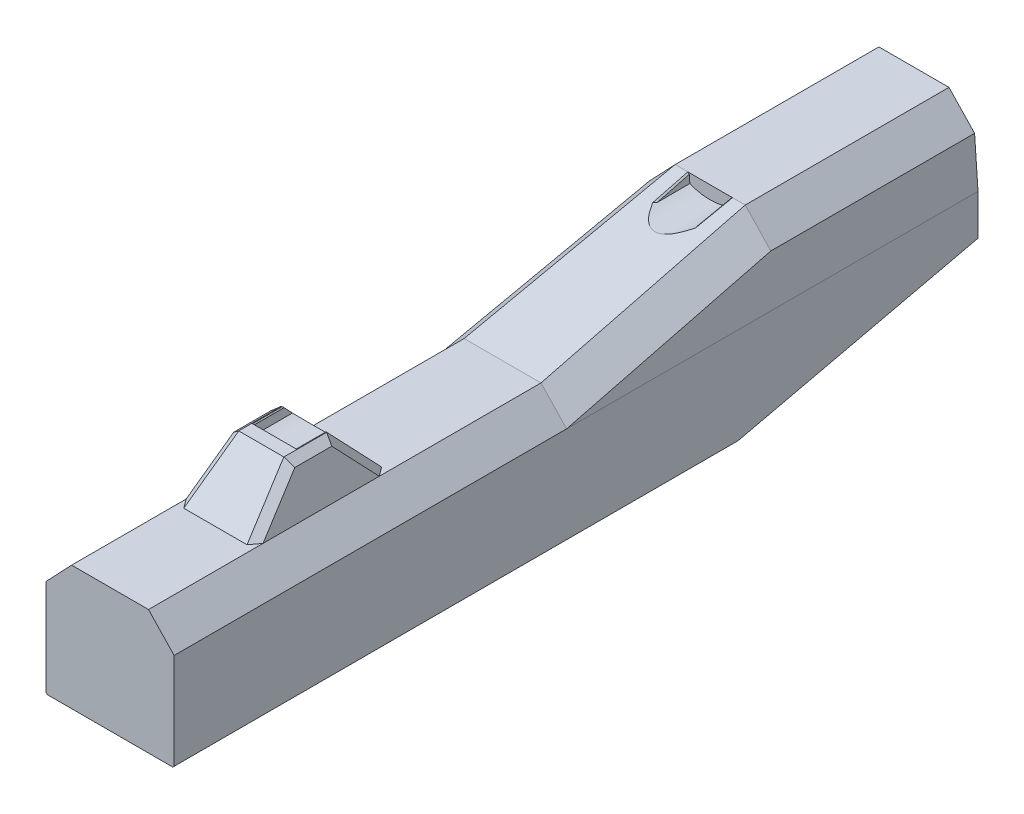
ISO-10303-21;
HEADER;
FILE_DESCRIPTION(('STEP AP214'),'2;1');
FILE_NAME('part.step','',(''),(''),'','','');
FILE_SCHEMA(('AUTOMOTIVE_DESIGN { 1 0 10303 214 1 1 1 1 }'));
ENDSEC;
DATA;
#1=APPLICATION_CONTEXT('core data for automotive mechanical design processes');
#2=APPLICATION_PROTOCOL_DEFINITION('international standard','automotive_design',2000,#1);
#3=PRODUCT_CONTEXT('',#1,'mechanical');
#4=PRODUCT('Part','Part','',(#3));
#5=PRODUCT_RELATED_PRODUCT_CATEGORY('part','',(#4));
#6=PRODUCT_DEFINITION_FORMATION('','',#4);
#7=PRODUCT_DEFINITION_CONTEXT('part definition',#1,'design');
#8=PRODUCT_DEFINITION('design','',#6,#7);
#9=PRODUCT_DEFINITION_SHAPE('','',#8);
#10=(LENGTH_UNIT() NAMED_UNIT(*) SI_UNIT(.MILLI.,.METRE.));
#11=(NAMED_UNIT(*) PLANE_ANGLE_UNIT() SI_UNIT($,.RADIAN.));
#12=(NAMED_UNIT(*) SI_UNIT($,.STERADIAN.) SOLID_ANGLE_UNIT());
#13=UNCERTAINTY_MEASURE_WITH_UNIT(LENGTH_MEASURE(1.E-05),#10,'distance_accuracy_value','');
#14=(GEOMETRIC_REPRESENTATION_CONTEXT(3) GLOBAL_UNCERTAINTY_ASSIGNED_CONTEXT((#13)) GLOBAL_UNIT_ASSIGNED_CONTEXT((#10,
#11,#12)) REPRESENTATION_CONTEXT('',''));
#15=CARTESIAN_POINT('',(0.,0.,0.));
#16=DIRECTION('',(0.,0.,1.));
#17=DIRECTION('',(1.,0.,0.));
#18=AXIS2_PLACEMENT_3D('',#15,#16,#17);
#19=CARTESIAN_POINT('',(0.,0.,-484.));
#20=DIRECTION('',(0.,0.,-1.));
#21=DIRECTION('',(0.,-1.,0.));
#22=AXIS2_PLACEMENT_3D('',#19,#20,#21);
#23=PLANE('',#22);
#24=DIRECTION('',(0.,-1.,0.));
#25=VECTOR('',#24,1.);
#26=CARTESIAN_POINT('',(35.,131.07828834,-484.));
#27=LINE('',#26,#25);
#28=CARTESIAN_POINT('',(35.,131.07828834,-484.));
#29=VERTEX_POINT('',#28);
#30=CARTESIAN_POINT('',(35.,61.07828834,-484.));
#31=VERTEX_POINT('',#30);
#32=EDGE_CURVE('E528',#29,#31,#27,.T.);
#33=ORIENTED_EDGE('',*,*,#32,.T.);
#34=DIRECTION('',(-1.,0.,0.));
#35=VECTOR('',#34,1.);
#36=CARTESIAN_POINT('',(35.,61.07828834,-484.));
#37=LINE('',#36,#35);
#38=CARTESIAN_POINT('',(-35.,61.07828834,-484.));
#39=VERTEX_POINT('',#38);
#40=EDGE_CURVE('E28',#31,#39,#37,.T.);
#41=ORIENTED_EDGE('',*,*,#40,.T.);
#42=DIRECTION('',(0.,1.,0.));
#43=VECTOR('',#42,1.);
#44=CARTESIAN_POINT('',(-35.,131.07828834,-484.));
#45=LINE('',#44,#43);
#46=CARTESIAN_POINT('',(-35.,131.07828834,-484.));
#47=VERTEX_POINT('',#46);
#48=EDGE_CURVE('E551',#39,#47,#45,.T.);
#49=ORIENTED_EDGE('',*,*,#48,.T.);
#50=DIRECTION('',(1.,0.,0.));
#51=VECTOR('',#50,1.);
#52=CARTESIAN_POINT('',(35.,131.07828834,-484.));
#53=LINE('',#52,#51);
#54=EDGE_CURVE('E10',#47,#29,#53,.T.);
#55=ORIENTED_EDGE('',*,*,#54,.T.);
#56=EDGE_LOOP('',(#33,#41,#49,#55));
#57=FACE_BOUND('',#56,.T.);
#58=ADVANCED_FACE('F16',(#57),#23,.T.);
#59=CARTESIAN_POINT('',(35.,131.07828834,-484.));
#60=DIRECTION('',(0.,1.,0.));
#61=DIRECTION('',(1.,0.,0.));
#62=AXIS2_PLACEMENT_3D('',#59,#60,#61);
#63=PLANE('',#62);
#64=DIRECTION('',(1.,0.,0.));
#65=VECTOR('',#64,1.);
#66=CARTESIAN_POINT('',(35.,131.07828834,-559.));
#67=LINE('',#66,#65);
#68=CARTESIAN_POINT('',(-35.,131.07828834,-559.));
#69=VERTEX_POINT('',#68);
#70=CARTESIAN_POINT('',(35.,131.07828834,-559.));
#71=VERTEX_POINT('',#70);
#72=EDGE_CURVE('E432',#69,#71,#67,.T.);
#73=ORIENTED_EDGE('',*,*,#72,.T.);
#74=DIRECTION('',(0.,0.,-1.));
#75=VECTOR('',#74,1.);
#76=CARTESIAN_POINT('',(35.,131.07828834,-484.));
#77=LINE('',#76,#75);
#78=EDGE_CURVE('E591',#29,#71,#77,.T.);
#79=ORIENTED_EDGE('',*,*,#78,.F.);
#80=ORIENTED_EDGE('',*,*,#54,.F.);
#81=DIRECTION('',(0.,0.,-1.));
#82=VECTOR('',#81,1.);
#83=CARTESIAN_POINT('',(-35.,131.07828834,-484.));
#84=LINE('',#83,#82);
#85=EDGE_CURVE('E558',#47,#69,#84,.T.);
#86=ORIENTED_EDGE('',*,*,#85,.T.);
#87=EDGE_LOOP('',(#73,#79,#80,#86));
#88=FACE_BOUND('',#87,.T.);
#89=ADVANCED_FACE('F952',(#88),#63,.F.);
#90=CARTESIAN_POINT('',(35.,61.07828834,-484.));
#91=DIRECTION('',(0.,-1.,0.));
#92=DIRECTION('',(-1.,0.,0.));
#93=AXIS2_PLACEMENT_3D('',#90,#91,#92);
#94=PLANE('',#93);
#95=DIRECTION('',(0.,0.,-1.));
#96=VECTOR('',#95,1.);
#97=CARTESIAN_POINT('',(-35.,61.07828834,-484.));
#98=LINE('',#97,#96);
#99=CARTESIAN_POINT('',(-35.,61.07828834,-519.575564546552));
#100=VERTEX_POINT('',#99);
#101=EDGE_CURVE('E557',#39,#100,#98,.T.);
#102=ORIENTED_EDGE('',*,*,#101,.F.);
#103=ORIENTED_EDGE('',*,*,#40,.F.);
#104=DIRECTION('',(0.,0.,-1.));
#105=VECTOR('',#104,1.);
#106=CARTESIAN_POINT('',(35.,61.07828834,-484.));
#107=LINE('',#106,#105);
#108=CARTESIAN_POINT('',(35.,61.07828834,-519.575564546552));
#109=VERTEX_POINT('',#108);
#110=EDGE_CURVE('E525',#31,#109,#107,.T.);
#111=ORIENTED_EDGE('',*,*,#110,.T.);
#112=DIRECTION('',(1.,0.,0.));
#113=VECTOR('',#112,1.);
#114=CARTESIAN_POINT('',(-47.505086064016,61.07828834,-519.575564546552));
#115=LINE('',#114,#113);
#116=EDGE_CURVE('E634',#100,#109,#115,.T.);
#117=ORIENTED_EDGE('',*,*,#116,.F.);
#118=EDGE_LOOP('',(#102,#103,#111,#117));
#119=FACE_BOUND('',#118,.T.);
#120=ADVANCED_FACE('F832',(#119),#94,.F.);
#121=CARTESIAN_POINT('',(-35.,131.07828834,-484.));
#122=DIRECTION('',(-1.,0.,0.));
#123=DIRECTION('',(0.,0.,1.));
#124=AXIS2_PLACEMENT_3D('',#121,#122,#123);
#125=PLANE('',#124);
#126=DIRECTION('',(0.,1.,0.));
#127=VECTOR('',#126,1.);
#128=CARTESIAN_POINT('',(-35.,131.07828834,-559.));
#129=LINE('',#128,#127);
#130=CARTESIAN_POINT('',(-35.,70.2189414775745,-559.));
#131=VERTEX_POINT('',#130);
#132=EDGE_CURVE('E625',#131,#69,#129,.T.);
#133=ORIENTED_EDGE('',*,*,#132,.T.);
#134=ORIENTED_EDGE('',*,*,#85,.F.);
#135=ORIENTED_EDGE('',*,*,#48,.F.);
#136=ORIENTED_EDGE('',*,*,#101,.T.);
#137=DIRECTION('',(0.,-0.225861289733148,0.974159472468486));
#138=VECTOR('',#137,1.);
#139=CARTESIAN_POINT('',(-35.,28.9977093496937,-381.209224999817));
#140=LINE('',#139,#138);
#141=EDGE_CURVE('E529',#131,#100,#140,.T.);
#142=ORIENTED_EDGE('',*,*,#141,.F.);
#143=EDGE_LOOP('',(#133,#134,#135,#136,#142));
#144=FACE_BOUND('',#143,.T.);
#145=ADVANCED_FACE('F2803',(#144),#125,.F.);
#146=CARTESIAN_POINT('',(35.,131.07828834,-484.));
#147=DIRECTION('',(1.,0.,0.));
#148=DIRECTION('',(0.,-1.,0.));
#149=AXIS2_PLACEMENT_3D('',#146,#147,#148);
#150=PLANE('',#149);
#151=ORIENTED_EDGE('',*,*,#110,.F.);
#152=ORIENTED_EDGE('',*,*,#32,.F.);
#153=ORIENTED_EDGE('',*,*,#78,.T.);
#154=DIRECTION('',(0.,-1.,0.));
#155=VECTOR('',#154,1.);
#156=CARTESIAN_POINT('',(35.,131.07828834,-559.));
#157=LINE('',#156,#155);
#158=CARTESIAN_POINT('',(35.,70.2189414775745,-559.));
#159=VERTEX_POINT('',#158);
#160=EDGE_CURVE('E425',#71,#159,#157,.T.);
#161=ORIENTED_EDGE('',*,*,#160,.T.);
#162=DIRECTION('',(0.,0.225861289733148,-0.974159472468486));
#163=VECTOR('',#162,1.);
#164=CARTESIAN_POINT('',(35.,28.9977093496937,-381.209224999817));
#165=LINE('',#164,#163);
#166=EDGE_CURVE('E629',#109,#159,#165,.T.);
#167=ORIENTED_EDGE('',*,*,#166,.F.);
#168=EDGE_LOOP('',(#151,#152,#153,#161,#167));
#169=FACE_BOUND('',#168,.T.);
#170=ADVANCED_FACE('F830',(#169),#150,.F.);
#171=CARTESIAN_POINT('',(-47.5050860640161,28.997723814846,112.487658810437));
#172=DIRECTION('',(0.,1.,-2.92996628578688E-08));
#173=DIRECTION('',(-1.,0.,0.));
#174=AXIS2_PLACEMENT_3D('',#171,#172,#173);
#175=PLANE('',#174);
#176=CARTESIAN_POINT('',(45.4762667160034,28.9977093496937,-381.209224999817));
#177=CARTESIAN_POINT('',(45.5185011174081,28.9977093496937,-381.209224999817));
#178=CARTESIAN_POINT('',(45.5607355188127,28.9977093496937,-381.209224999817));
#179=CARTESIAN_POINT('',(45.6029699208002,28.9977030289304,-381.209224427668));
#180=(BOUNDED_CURVE() B_SPLINE_CURVE(3,(#176,#177,#178,#179),.UNSPECIFIED.,.F.,
.F.) B_SPLINE_CURVE_WITH_KNOTS((4,4),(0.,1.),
.UNSPECIFIED.) CURVE() GEOMETRIC_REPRESENTATION_ITEM() RATIONAL_B_SPLINE_CURVE((1.,1.,1.,1.)) REPRESENTATION_ITEM(''));
#181=CARTESIAN_POINT('',(45.4762667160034,28.9977093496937,-381.209224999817));
#182=VERTEX_POINT('',#181);
#183=CARTESIAN_POINT('',(45.6029699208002,28.9977061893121,-381.209224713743));
#184=VERTEX_POINT('',#183);
#185=EDGE_CURVE('E690',#182,#184,#180,.T.);
#186=ORIENTED_EDGE('',*,*,#185,.T.);
#187=DIRECTION('',(1.,0.,0.));
#188=VECTOR('',#187,1.);
#189=CARTESIAN_POINT('',(-47.5050860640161,28.9977093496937,-381.209224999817));
#190=LINE('',#189,#188);
#191=CARTESIAN_POINT('',(46.4999760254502,28.997687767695,-381.209223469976));
#192=VERTEX_POINT('',#191);
#193=EDGE_CURVE('E633',#184,#192,#190,.T.);
#194=ORIENTED_EDGE('',*,*,#193,.T.);
#195=CARTESIAN_POINT('',(46.4999489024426,28.99767430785,37.0000000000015));
#196=DIRECTION('',(4.85229564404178E-08,4.85182277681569E-08,-0.999999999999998));
#197=VECTOR('',#196,1.);
#198=LINE('',#195,#197);
#199=CARTESIAN_POINT('',(46.4999381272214,28.9976850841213,37.0000000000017));
#200=VERTEX_POINT('',#199);
#201=EDGE_CURVE('E721',#200,#192,#198,.T.);
#202=ORIENTED_EDGE('',*,*,#201,.F.);
#203=DIRECTION('',(1.,0.,0.));
#204=VECTOR('',#203,1.);
#205=CARTESIAN_POINT('',(13.86383202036,28.997721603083,37.0000000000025));
#206=LINE('',#205,#204);
#207=CARTESIAN_POINT('',(-46.499943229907,28.9976850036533,37.0000000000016));
#208=VERTEX_POINT('',#207);
#209=EDGE_CURVE('E710',#208,#200,#206,.T.);
#210=ORIENTED_EDGE('',*,*,#209,.F.);
#211=CARTESIAN_POINT('',(-46.499943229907,28.997721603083,37.0000000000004));
#212=DIRECTION('',(-7.84227216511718E-08,-2.92996628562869E-08,-0.999999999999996));
#213=VECTOR('',#212,1.);
#214=LINE('',#211,#213);
#215=CARTESIAN_POINT('',(-46.4999760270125,28.9976877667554,-381.209223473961));
#216=VERTEX_POINT('',#215);
#217=EDGE_CURVE('E854',#208,#216,#214,.T.);
#218=ORIENTED_EDGE('',*,*,#217,.T.);
#219=DIRECTION('',(1.,0.,0.));
#220=VECTOR('',#219,1.);
#221=CARTESIAN_POINT('',(-47.5050860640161,28.9977093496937,-381.209224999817));
#222=LINE('',#221,#220);
#223=CARTESIAN_POINT('',(-45.6029699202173,28.9977093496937,-381.209224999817));
#224=VERTEX_POINT('',#223);
#225=EDGE_CURVE('E583',#216,#224,#222,.T.);
#226=ORIENTED_EDGE('',*,*,#225,.T.);
#227=CARTESIAN_POINT('',(-45.6029699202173,28.9977093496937,-381.209224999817));
#228=CARTESIAN_POINT('',(-45.5607354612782,28.9977093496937,-381.209224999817));
#229=CARTESIAN_POINT('',(-45.518501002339,28.9977093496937,-381.209224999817));
#230=CARTESIAN_POINT('',(-45.476266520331,28.9977093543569,-381.209225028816));
#231=(BOUNDED_CURVE() B_SPLINE_CURVE(3,(#227,#228,#229,#230),.UNSPECIFIED.,.F.,
.F.) B_SPLINE_CURVE_WITH_KNOTS((4,4),(0.,1.),
.UNSPECIFIED.) CURVE() GEOMETRIC_REPRESENTATION_ITEM() RATIONAL_B_SPLINE_CURVE((1.,1.,1.,1.)) REPRESENTATION_ITEM(''));
#232=CARTESIAN_POINT('',(-45.476266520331,28.9977093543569,-381.209225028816));
#233=VERTEX_POINT('',#232);
#234=EDGE_CURVE('E574',#224,#233,#231,.T.);
#235=ORIENTED_EDGE('',*,*,#234,.T.);
#236=DIRECTION('',(1.,0.,0.));
#237=VECTOR('',#236,1.);
#238=CARTESIAN_POINT('',(-47.5050860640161,28.9977093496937,-381.209224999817));
#239=LINE('',#238,#237);
#240=EDGE_CURVE('E423',#233,#182,#239,.T.);
#241=ORIENTED_EDGE('',*,*,#240,.T.);
#242=EDGE_LOOP('',(#186,#194,#202,#210,#218,#226,#235,#241));
#243=FACE_BOUND('',#242,.T.);
#244=ADVANCED_FACE('F819',(#243),#175,.F.);
#245=CARTESIAN_POINT('',(-47.5050860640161,28.9977093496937,-381.209224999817));
#246=DIRECTION('',(0.,0.974159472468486,0.225861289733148));
#247=DIRECTION('',(1.,0.,0.));
#248=AXIS2_PLACEMENT_3D('',#245,#246,#247);
#249=PLANE('',#248);
#250=ORIENTED_EDGE('',*,*,#116,.T.);
#251=ORIENTED_EDGE('',*,*,#166,.T.);
#252=DIRECTION('',(-1.,0.,0.));
#253=VECTOR('',#252,1.);
#254=CARTESIAN_POINT('',(-48.45037440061,70.2189414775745,-559.));
#255=LINE('',#254,#253);
#256=CARTESIAN_POINT('',(45.4208076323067,70.1876073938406,-558.875252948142));
#257=VERTEX_POINT('',#256);
#258=EDGE_CURVE('E433',#257,#159,#255,.T.);
#259=ORIENTED_EDGE('',*,*,#258,.F.);
#260=DIRECTION('',(-0.000934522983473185,-0.225861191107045,0.974159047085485));
#261=VECTOR('',#260,1.);
#262=CARTESIAN_POINT('',(46.5852667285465,49.6040175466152,-470.086032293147));
#263=LINE('',#262,#261);
#264=EDGE_CURVE('E441',#257,#192,#263,.T.);
#265=ORIENTED_EDGE('',*,*,#264,.T.);
#266=ORIENTED_EDGE('',*,*,#193,.F.);
#267=ORIENTED_EDGE('',*,*,#185,.F.);
#268=ORIENTED_EDGE('',*,*,#240,.F.);
#269=ORIENTED_EDGE('',*,*,#234,.F.);
#270=ORIENTED_EDGE('',*,*,#225,.F.);
#271=DIRECTION('',(0.000934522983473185,-0.225861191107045,0.974159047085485));
#272=VECTOR('',#271,1.);
#273=CARTESIAN_POINT('',(-46.5852667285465,49.6040175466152,-470.086032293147));
#274=LINE('',#273,#272);
#275=CARTESIAN_POINT('',(-46.669639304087,70.2056606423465,-558.942708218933));
#276=VERTEX_POINT('',#275);
#277=EDGE_CURVE('E675',#276,#216,#274,.T.);
#278=ORIENTED_EDGE('',*,*,#277,.F.);
#279=CARTESIAN_POINT('',(-46.669639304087,70.2056583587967,-558.94270874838));
#280=DIRECTION('',(0.999998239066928,-0.000423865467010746,0.00182816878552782));
#281=VECTOR('',#280,1.);
#282=LINE('',#279,#281);
#283=CARTESIAN_POINT('',(-45.4802085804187,70.2051541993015,-558.940534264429));
#284=VERTEX_POINT('',#283);
#285=EDGE_CURVE('E1108',#276,#284,#282,.T.);
#286=ORIENTED_EDGE('',*,*,#285,.T.);
#287=DIRECTION('',(-2.16067455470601E-05,0.225861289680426,-0.974159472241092));
#288=VECTOR('',#287,1.);
#289=CARTESIAN_POINT('',(-45.5587661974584,891.38966160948,-4100.78104833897));
#290=LINE('',#289,#288);
#291=CARTESIAN_POINT('',(-45.4802098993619,70.2189414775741,-559.));
#292=VERTEX_POINT('',#291);
#293=EDGE_CURVE('E2419',#284,#292,#290,.T.);
#294=ORIENTED_EDGE('',*,*,#293,.T.);
#295=DIRECTION('',(-1.,0.,0.));
#296=VECTOR('',#295,1.);
#297=CARTESIAN_POINT('',(-48.45037440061,70.2189414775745,-559.));
#298=LINE('',#297,#296);
#299=EDGE_CURVE('E497',#131,#292,#298,.T.);
#300=ORIENTED_EDGE('',*,*,#299,.F.);
#301=ORIENTED_EDGE('',*,*,#141,.T.);
#302=EDGE_LOOP('',(#250,#251,#259,#265,#266,#267,#268,#269,#270,#278,#286,#294,#300,#301));
#303=FACE_BOUND('',#302,.T.);
#304=ADVANCED_FACE('F829',(#303),#249,.F.);
#305=CARTESIAN_POINT('',(13.86383202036,119.3824409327,37.));
#306=DIRECTION('',(0.,0.,-1.));
#307=DIRECTION('',(0.,-1.,0.));
#308=AXIS2_PLACEMENT_3D('',#305,#306,#307);
#309=PLANE('',#308);
#310=CARTESIAN_POINT('',(-47.5000125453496,29.9976503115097,37.0000000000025));
#311=DIRECTION('',(0.707143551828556,-0.70707000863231,0.));
#312=VECTOR('',#311,1.);
#313=LINE('',#310,#312);
#314=CARTESIAN_POINT('',(-47.5000125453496,29.9976503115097,37.0000000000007));
#315=VERTEX_POINT('',#314);
#316=EDGE_CURVE('E697',#315,#208,#313,.T.);
#317=ORIENTED_EDGE('',*,*,#316,.T.);
#318=ORIENTED_EDGE('',*,*,#209,.T.);
#319=DIRECTION('',(0.707141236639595,0.707072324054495,0.));
#320=VECTOR('',#319,1.);
#321=CARTESIAN_POINT('',(46.99994567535,29.49762235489,37.000000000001));
#322=LINE('',#321,#320);
#323=CARTESIAN_POINT('',(47.500014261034,29.9976475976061,37.000000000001));
#324=VERTEX_POINT('',#323);
#325=EDGE_CURVE('E713',#324,#200,#322,.F.);
#326=ORIENTED_EDGE('',*,*,#325,.F.);
#327=DIRECTION('',(1.05684182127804E-06,0.999999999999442,0.));
#328=VECTOR('',#327,1.);
#329=CARTESIAN_POINT('',(47.50006910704,101.182873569,37.));
#330=LINE('',#329,#328);
#331=CARTESIAN_POINT('',(47.5000506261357,101.182903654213,37.));
#332=VERTEX_POINT('',#331);
#333=EDGE_CURVE('E1507',#332,#324,#330,.F.);
#334=ORIENTED_EDGE('',*,*,#333,.F.);
#335=CARTESIAN_POINT('',(45.46912855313,103.32069930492,37.0000000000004));
#336=CARTESIAN_POINT('',(46.1460965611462,102.608103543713,37.0000000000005));
#337=CARTESIAN_POINT('',(46.8230645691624,101.895507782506,37.0000000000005));
#338=CARTESIAN_POINT('',(47.5000506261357,101.182903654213,37.));
#339=(BOUNDED_CURVE() B_SPLINE_CURVE(3,(#335,#336,#337,#338),.UNSPECIFIED.,.F.,
.F.) B_SPLINE_CURVE_WITH_KNOTS((4,4),(0.893108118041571,1.),
.UNSPECIFIED.) CURVE() GEOMETRIC_REPRESENTATION_ITEM() RATIONAL_B_SPLINE_CURVE((1.,1.,1.,1.)) REPRESENTATION_ITEM(''));
#340=CARTESIAN_POINT('',(45.46912855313,103.32069930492,37.0000000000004));
#341=VERTEX_POINT('',#340);
#342=EDGE_CURVE('E764',#341,#332,#339,.T.);
#343=ORIENTED_EDGE('',*,*,#342,.F.);
#344=DIRECTION('',(0.688750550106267,-0.724998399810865,0.));
#345=VECTOR('',#344,1.);
#346=CARTESIAN_POINT('',(28.50042300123,121.1824409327,37.));
#347=LINE('',#346,#345);
#348=CARTESIAN_POINT('',(28.5003668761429,121.182454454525,37.));
#349=VERTEX_POINT('',#348);
#350=EDGE_CURVE('E772',#349,#341,#347,.T.);
#351=ORIENTED_EDGE('',*,*,#350,.F.);
#352=DIRECTION('',(1.,0.,0.));
#353=VECTOR('',#352,1.);
#354=CARTESIAN_POINT('',(-28.50042300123,121.1824409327,37.));
#355=LINE('',#354,#353);
#356=CARTESIAN_POINT('',(-28.5003655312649,121.182478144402,37.));
#357=VERTEX_POINT('',#356);
#358=EDGE_CURVE('E2406',#357,#349,#355,.T.);
#359=ORIENTED_EDGE('',*,*,#358,.F.);
#360=DIRECTION('',(0.688750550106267,0.724998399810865,0.));
#361=VECTOR('',#360,1.);
#362=CARTESIAN_POINT('',(-28.50042300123,121.1824409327,36.9999999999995));
#363=LINE('',#362,#361);
#364=CARTESIAN_POINT('',(-45.4835137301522,103.305557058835,37.));
#365=VERTEX_POINT('',#364);
#366=EDGE_CURVE('E3399',#365,#357,#363,.T.);
#367=ORIENTED_EDGE('',*,*,#366,.F.);
#368=CARTESIAN_POINT('',(-47.5000504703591,101.182904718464,37.));
#369=CARTESIAN_POINT('',(-46.8278596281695,101.890460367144,37.));
#370=CARTESIAN_POINT('',(-46.1556866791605,102.598008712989,37.));
#371=CARTESIAN_POINT('',(-45.4835137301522,103.305557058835,37.));
#372=(BOUNDED_CURVE() B_SPLINE_CURVE(3,(#368,#369,#370,#371),.UNSPECIFIED.,.F.,
.F.) B_SPLINE_CURVE_WITH_KNOTS((4,4),(0.,0.106134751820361),
.UNSPECIFIED.) CURVE() GEOMETRIC_REPRESENTATION_ITEM() RATIONAL_B_SPLINE_CURVE((1.,1.,1.,1.)) REPRESENTATION_ITEM(''));
#373=CARTESIAN_POINT('',(-47.5000504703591,101.182904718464,37.));
#374=VERTEX_POINT('',#373);
#375=EDGE_CURVE('E937',#374,#365,#372,.T.);
#376=ORIENTED_EDGE('',*,*,#375,.F.);
#377=DIRECTION('',(-1.05684182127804E-06,0.999999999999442,0.));
#378=VECTOR('',#377,1.);
#379=CARTESIAN_POINT('',(-47.50006910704,101.182873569,37.0000000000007));
#380=LINE('',#379,#378);
#381=EDGE_CURVE('E1522',#315,#374,#380,.T.);
#382=ORIENTED_EDGE('',*,*,#381,.F.);
#383=EDGE_LOOP('',(#317,#318,#326,#334,#343,#351,#359,#367,#376,#382));
#384=FACE_BOUND('',#383,.T.);
#385=ADVANCED_FACE('F739',(#384),#309,.F.);
#386=CARTESIAN_POINT('',(46.99994567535,29.49762235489,-172.1044547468));
#387=DIRECTION('',(0.707072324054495,-0.707141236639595,0.));
#388=DIRECTION('',(0.,0.,-1.));
#389=AXIS2_PLACEMENT_3D('',#386,#387,#388);
#390=PLANE('',#389);
#391=ORIENTED_EDGE('',*,*,#201,.T.);
#392=CARTESIAN_POINT('',(46.4999760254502,28.997687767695,-381.209223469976));
#393=CARTESIAN_POINT('',(46.8332955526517,29.3309884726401,-381.17114574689));
#394=CARTESIAN_POINT('',(47.1666480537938,29.6643084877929,-381.133067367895));
#395=CARTESIAN_POINT('',(47.499997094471,29.9976298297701,-381.094989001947));
#396=(BOUNDED_CURVE() B_SPLINE_CURVE(3,(#392,#393,#394,#395),.UNSPECIFIED.,.F.,
.F.) B_SPLINE_CURVE_WITH_KNOTS((4,4),(0.,1.),
.UNSPECIFIED.) CURVE() GEOMETRIC_REPRESENTATION_ITEM() RATIONAL_B_SPLINE_CURVE((1.,1.,1.,1.)) REPRESENTATION_ITEM(''));
#397=CARTESIAN_POINT('',(47.499997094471,29.9976298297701,-381.094989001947));
#398=VERTEX_POINT('',#397);
#399=EDGE_CURVE('E693',#192,#398,#396,.T.);
#400=ORIENTED_EDGE('',*,*,#399,.T.);
#401=CARTESIAN_POINT('',(47.4999938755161,29.9976475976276,37.000000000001));
#402=DIRECTION('',(0.,-4.24971709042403E-08,-0.999999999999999));
#403=VECTOR('',#402,1.);
#404=LINE('',#401,#403);
#405=EDGE_CURVE('E815',#324,#398,#404,.T.);
#406=ORIENTED_EDGE('',*,*,#405,.F.);
#407=ORIENTED_EDGE('',*,*,#325,.T.);
#408=EDGE_LOOP('',(#391,#400,#406,#407));
#409=FACE_BOUND('',#408,.T.);
#410=ADVANCED_FACE('F728',(#409),#390,.T.);
#411=CARTESIAN_POINT('',(47.50006910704,101.182873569,37.));
#412=DIRECTION('',(0.999999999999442,-1.05684182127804E-06,0.));
#413=DIRECTION('',(0.,0.,-1.));
#414=AXIS2_PLACEMENT_3D('',#411,#412,#413);
#415=PLANE('',#414);
#416=ORIENTED_EDGE('',*,*,#333,.T.);
#417=ORIENTED_EDGE('',*,*,#405,.T.);
#418=CARTESIAN_POINT('',(47.499997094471,29.9976298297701,-381.094989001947));
#419=CARTESIAN_POINT('',(47.5000071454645,42.5538769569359,-435.482071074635));
#420=CARTESIAN_POINT('',(47.5000204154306,55.1101231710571,-489.869153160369));
#421=CARTESIAN_POINT('',(47.5000348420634,67.6663690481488,-544.256235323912));
#422=(BOUNDED_CURVE() B_SPLINE_CURVE(3,(#418,#419,#420,#421),.UNSPECIFIED.,.F.,
.F.) B_SPLINE_CURVE_WITH_KNOTS((4,4),(0.,1.),
.UNSPECIFIED.) CURVE() GEOMETRIC_REPRESENTATION_ITEM() RATIONAL_B_SPLINE_CURVE((1.,1.,1.,1.)) REPRESENTATION_ITEM(''));
#423=CARTESIAN_POINT('',(47.5000348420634,67.6663690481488,-544.256235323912));
#424=VERTEX_POINT('',#423);
#425=EDGE_CURVE('E440',#398,#424,#422,.T.);
#426=ORIENTED_EDGE('',*,*,#425,.T.);
#427=CARTESIAN_POINT('',(47.5000436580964,71.0702432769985,-559.000000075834));
#428=CARTESIAN_POINT('',(47.5000386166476,69.9356131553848,-554.085412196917));
#429=CARTESIAN_POINT('',(47.5000373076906,68.8009909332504,-549.17082379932));
#430=CARTESIAN_POINT('',(47.5000348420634,67.6663690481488,-544.256235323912));
#431=(BOUNDED_CURVE() B_SPLINE_CURVE(3,(#427,#428,#429,#430),.UNSPECIFIED.,.F.,
.F.) B_SPLINE_CURVE_WITH_KNOTS((4,4),(0.,1.),
.UNSPECIFIED.) CURVE() GEOMETRIC_REPRESENTATION_ITEM() RATIONAL_B_SPLINE_CURVE((1.,1.,1.,1.)) REPRESENTATION_ITEM(''));
#432=CARTESIAN_POINT('',(47.5000436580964,71.0702432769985,-559.000000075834));
#433=VERTEX_POINT('',#432);
#434=EDGE_CURVE('E434',#433,#424,#431,.T.);
#435=ORIENTED_EDGE('',*,*,#434,.F.);
#436=CARTESIAN_POINT('',(47.5000436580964,71.0702432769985,-559.000000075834));
#437=CARTESIAN_POINT('',(47.5000478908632,81.1078004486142,-559.));
#438=CARTESIAN_POINT('',(47.5000584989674,91.1453520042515,-559.));
#439=CARTESIAN_POINT('',(47.5000639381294,101.182905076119,-559.));
#440=(BOUNDED_CURVE() B_SPLINE_CURVE(3,(#436,#437,#438,#439),.UNSPECIFIED.,.F.,
.F.) B_SPLINE_CURVE_WITH_KNOTS((4,4),(0.,1.),
.UNSPECIFIED.) CURVE() GEOMETRIC_REPRESENTATION_ITEM() RATIONAL_B_SPLINE_CURVE((1.,1.,1.,1.)) REPRESENTATION_ITEM(''));
#441=CARTESIAN_POINT('',(47.5000639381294,101.182905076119,-559.));
#442=VERTEX_POINT('',#441);
#443=EDGE_CURVE('E473',#433,#442,#440,.T.);
#444=ORIENTED_EDGE('',*,*,#443,.T.);
#445=CARTESIAN_POINT('',(47.5000639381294,101.182905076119,-559.));
#446=CARTESIAN_POINT('',(47.5000691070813,101.182912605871,-457.333124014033));
#447=CARTESIAN_POINT('',(47.5000691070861,101.182917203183,-355.666248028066));
#448=CARTESIAN_POINT('',(47.5000644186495,101.182921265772,-253.999370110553));
#449=(BOUNDED_CURVE() B_SPLINE_CURVE(3,(#445,#446,#447,#448),.UNSPECIFIED.,.F.,
.F.) B_SPLINE_CURVE_WITH_KNOTS((4,4),(0.,1.),
.UNSPECIFIED.) CURVE() GEOMETRIC_REPRESENTATION_ITEM() RATIONAL_B_SPLINE_CURVE((1.,1.,1.,1.)) REPRESENTATION_ITEM(''));
#450=CARTESIAN_POINT('',(47.5000644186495,101.182921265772,-253.999370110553));
#451=VERTEX_POINT('',#450);
#452=EDGE_CURVE('E2333',#442,#451,#449,.T.);
#453=ORIENTED_EDGE('',*,*,#452,.T.);
#454=CARTESIAN_POINT('',(47.5000691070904,101.182921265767,-253.999370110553));
#455=DIRECTION('',(0.,-6.05210031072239E-08,0.999999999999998));
#456=VECTOR('',#455,1.);
#457=LINE('',#454,#456);
#458=EDGE_CURVE('E771',#451,#332,#457,.T.);
#459=ORIENTED_EDGE('',*,*,#458,.T.);
#460=EDGE_LOOP('',(#416,#417,#426,#435,#444,#453,#459));
#461=FACE_BOUND('',#460,.T.);
#462=ADVANCED_FACE('F738',(#461),#415,.T.);
#463=CARTESIAN_POINT('',(28.50042300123,121.1824409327,37.));
#464=DIRECTION('',(0.724998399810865,0.688750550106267,0.));
#465=DIRECTION('',(0.,0.,-1.));
#466=AXIS2_PLACEMENT_3D('',#463,#464,#465);
#467=PLANE('',#466);
#468=CARTESIAN_POINT('',(47.5000430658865,101.182900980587,-253.999370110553));
#469=DIRECTION('',(-0.688750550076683,0.724998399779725,-9.26849458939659E-06));
#470=VECTOR('',#469,1.);
#471=LINE('',#468,#470);
#472=CARTESIAN_POINT('',(28.5003774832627,121.182409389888,-253.999625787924));
#473=VERTEX_POINT('',#472);
#474=EDGE_CURVE('E3282',#451,#473,#471,.T.);
#475=ORIENTED_EDGE('',*,*,#474,.T.);
#476=CARTESIAN_POINT('',(28.5004171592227,121.182447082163,-253.999625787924));
#477=DIRECTION('',(-1.40168923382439E-06,1.4754579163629E-06,0.999999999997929));
#478=VECTOR('',#477,1.);
#479=LINE('',#476,#478);
#480=CARTESIAN_POINT('',(28.5001595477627,121.182538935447,-134.093352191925));
#481=VERTEX_POINT('',#480);
#482=EDGE_CURVE('E2301',#473,#481,#479,.T.);
#483=ORIENTED_EDGE('',*,*,#482,.T.);
#484=CARTESIAN_POINT('',(28.5002490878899,121.182623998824,-134.093352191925));
#485=DIRECTION('',(-6.84191019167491E-09,7.20198907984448E-09,1.));
#486=VECTOR('',#485,1.);
#487=LINE('',#484,#486);
#488=CARTESIAN_POINT('',(28.5001615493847,121.182542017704,-47.9215742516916));
#489=VERTEX_POINT('',#488);
#490=EDGE_CURVE('E2296',#481,#489,#487,.T.);
#491=ORIENTED_EDGE('',*,*,#490,.T.);
#492=CARTESIAN_POINT('',(28.5002484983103,121.182624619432,-47.9215742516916));
#493=DIRECTION('',(1.66184415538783E-06,-1.74930437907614E-06,0.999999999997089));
#494=VECTOR('',#493,1.);
#495=LINE('',#492,#494);
#496=EDGE_CURVE('E2401',#489,#349,#495,.T.);
#497=ORIENTED_EDGE('',*,*,#496,.T.);
#498=ORIENTED_EDGE('',*,*,#350,.T.);
#499=ORIENTED_EDGE('',*,*,#342,.T.);
#500=ORIENTED_EDGE('',*,*,#458,.F.);
#501=EDGE_LOOP('',(#475,#483,#491,#497,#498,#499,#500));
#502=FACE_BOUND('',#501,.T.);
#503=ADVANCED_FACE('F799',(#502),#467,.T.);
#504=CARTESIAN_POINT('',(-28.50042300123,121.1824409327,37.));
#505=DIRECTION('',(0.,1.,0.));
#506=DIRECTION('',(1.,0.,0.));
#507=AXIS2_PLACEMENT_3D('',#504,#505,#506);
#508=PLANE('',#507);
#509=CARTESIAN_POINT('',(23.453742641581,121.1824409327,-41.0973387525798));
#510=CARTESIAN_POINT('',(7.81791421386,121.1824409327,-41.09733875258));
#511=CARTESIAN_POINT('',(-7.81791421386,121.1824409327,-41.09733875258));
#512=CARTESIAN_POINT('',(-23.453742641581,121.1824409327,-41.0973387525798));
#513=(BOUNDED_CURVE() B_SPLINE_CURVE(3,(#509,#510,#511,#512),.UNSPECIFIED.,.F.,
.F.) B_SPLINE_CURVE_WITH_KNOTS((4,4),(0.,1.),
.UNSPECIFIED.) CURVE() GEOMETRIC_REPRESENTATION_ITEM() RATIONAL_B_SPLINE_CURVE((1.,1.,1.,1.)) REPRESENTATION_ITEM(''));
#514=CARTESIAN_POINT('',(23.453742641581,121.1824409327,-41.0973387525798));
#515=VERTEX_POINT('',#514);
#516=CARTESIAN_POINT('',(-23.453742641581,121.1824409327,-41.0973387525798));
#517=VERTEX_POINT('',#516);
#518=EDGE_CURVE('E2292',#515,#517,#513,.T.);
#519=ORIENTED_EDGE('',*,*,#518,.T.);
#520=CARTESIAN_POINT('',(-23.453742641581,121.1824409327,-41.0973387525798));
#521=DIRECTION('',(-0.594575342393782,0.,-0.804039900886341));
#522=VECTOR('',#521,1.);
#523=LINE('',#520,#522);
#524=CARTESIAN_POINT('',(-28.5001615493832,121.182542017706,-47.9215742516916));
#525=VERTEX_POINT('',#524);
#526=EDGE_CURVE('E391',#517,#525,#523,.T.);
#527=ORIENTED_EDGE('',*,*,#526,.T.);
#528=CARTESIAN_POINT('',(-28.5001615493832,121.1824409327,-47.9215742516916));
#529=DIRECTION('',(-2.4020030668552E-06,0.,0.999999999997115));
#530=VECTOR('',#529,1.);
#531=LINE('',#528,#530);
#532=EDGE_CURVE('E3351',#525,#357,#531,.T.);
#533=ORIENTED_EDGE('',*,*,#532,.T.);
#534=ORIENTED_EDGE('',*,*,#358,.T.);
#535=ORIENTED_EDGE('',*,*,#496,.F.);
#536=CARTESIAN_POINT('',(23.4537426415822,121.182440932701,-41.0973387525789));
#537=DIRECTION('',(0.594580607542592,1.65777149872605E-05,-0.804036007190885));
#538=VECTOR('',#537,1.);
#539=LINE('',#536,#538);
#540=EDGE_CURVE('E395',#515,#489,#539,.T.);
#541=ORIENTED_EDGE('',*,*,#540,.F.);
#542=EDGE_LOOP('',(#519,#527,#533,#534,#535,#541));
#543=FACE_BOUND('',#542,.T.);
#544=ADVANCED_FACE('F948',(#543),#508,.T.);
#545=CARTESIAN_POINT('',(-28.50042300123,121.1824409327,37.));
#546=DIRECTION('',(0.724998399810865,-0.688750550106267,0.));
#547=DIRECTION('',(0.,0.,-1.));
#548=AXIS2_PLACEMENT_3D('',#545,#546,#547);
#549=PLANE('',#548);
#550=ORIENTED_EDGE('',*,*,#375,.T.);
#551=ORIENTED_EDGE('',*,*,#366,.T.);
#552=ORIENTED_EDGE('',*,*,#532,.F.);
#553=CARTESIAN_POINT('',(-28.500047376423,121.182517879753,-134.093352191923));
#554=DIRECTION('',(5.69506792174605E-09,3.03397145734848E-08,1.));
#555=VECTOR('',#554,1.);
#556=LINE('',#553,#555);
#557=CARTESIAN_POINT('',(-28.500159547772,121.182538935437,-134.093352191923));
#558=VERTEX_POINT('',#557);
#559=EDGE_CURVE('E1874',#558,#525,#556,.T.);
#560=ORIENTED_EDGE('',*,*,#559,.F.);
#561=CARTESIAN_POINT('',(-28.500377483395,121.1824409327,-253.999625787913));
#562=DIRECTION('',(1.81754979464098E-06,0.,0.999999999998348));
#563=VECTOR('',#562,1.);
#564=LINE('',#561,#563);
#565=CARTESIAN_POINT('',(-28.500377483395,121.182409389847,-253.999625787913));
#566=VERTEX_POINT('',#565);
#567=EDGE_CURVE('E2368',#566,#558,#564,.T.);
#568=ORIENTED_EDGE('',*,*,#567,.F.);
#569=CARTESIAN_POINT('',(-47.5000859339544,101.182941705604,-253.999365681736));
#570=DIRECTION('',(0.688753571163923,0.724995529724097,-9.43497236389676E-06));
#571=VECTOR('',#570,1.);
#572=LINE('',#569,#571);
#573=CARTESIAN_POINT('',(-47.5000644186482,101.182921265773,-253.999370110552));
#574=VERTEX_POINT('',#573);
#575=EDGE_CURVE('E983',#574,#566,#572,.T.);
#576=ORIENTED_EDGE('',*,*,#575,.F.);
#577=CARTESIAN_POINT('',(-47.5000691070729,101.182904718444,37.));
#578=DIRECTION('',(0.,5.68637792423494E-08,-0.999999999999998));
#579=VECTOR('',#578,1.);
#580=LINE('',#577,#579);
#581=EDGE_CURVE('E932',#374,#574,#580,.T.);
#582=ORIENTED_EDGE('',*,*,#581,.F.);
#583=EDGE_LOOP('',(#550,#551,#552,#560,#568,#576,#582));
#584=FACE_BOUND('',#583,.T.);
#585=ADVANCED_FACE('F908',(#584),#549,.F.);
#586=CARTESIAN_POINT('',(-47.50006910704,101.182873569,37.));
#587=DIRECTION('',(0.999999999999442,1.05684182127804E-06,0.));
#588=DIRECTION('',(0.,0.,-1.));
#589=AXIS2_PLACEMENT_3D('',#586,#587,#588);
#590=PLANE('',#589);
#591=CARTESIAN_POINT('',(-47.5000454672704,71.0702430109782,-559.000000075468));
#592=CARTESIAN_POINT('',(-47.5000478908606,81.1077946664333,-559.));
#593=CARTESIAN_POINT('',(-47.5000584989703,91.1453513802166,-559.));
#594=CARTESIAN_POINT('',(-47.5000646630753,101.18290612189,-559.));
#595=(BOUNDED_CURVE() B_SPLINE_CURVE(3,(#591,#592,#593,#594),.UNSPECIFIED.,.F.,
.F.) B_SPLINE_CURVE_WITH_KNOTS((4,4),(0.,1.),
.UNSPECIFIED.) CURVE() GEOMETRIC_REPRESENTATION_ITEM() RATIONAL_B_SPLINE_CURVE((1.,1.,1.,1.)) REPRESENTATION_ITEM(''));
#596=CARTESIAN_POINT('',(-47.5000454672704,71.0702430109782,-559.000000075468));
#597=VERTEX_POINT('',#596);
#598=CARTESIAN_POINT('',(-47.5000646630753,101.18290612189,-559.));
#599=VERTEX_POINT('',#598);
#600=EDGE_CURVE('E478',#597,#599,#595,.T.);
#601=ORIENTED_EDGE('',*,*,#600,.F.);
#602=CARTESIAN_POINT('',(-47.5000454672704,71.0702430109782,-559.000000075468));
#603=CARTESIAN_POINT('',(-47.5000360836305,69.9356150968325,-554.0854117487));
#604=CARTESIAN_POINT('',(-47.5000348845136,68.800992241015,-549.170823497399));
#605=CARTESIAN_POINT('',(-47.5000348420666,67.6663690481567,-544.25623532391));
#606=(BOUNDED_CURVE() B_SPLINE_CURVE(3,(#602,#603,#604,#605),.UNSPECIFIED.,.F.,
.F.) B_SPLINE_CURVE_WITH_KNOTS((4,4),(0.,1.),
.UNSPECIFIED.) CURVE() GEOMETRIC_REPRESENTATION_ITEM() RATIONAL_B_SPLINE_CURVE((1.,1.,1.,1.)) REPRESENTATION_ITEM(''));
#607=CARTESIAN_POINT('',(-47.5000348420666,67.6663690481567,-544.25623532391));
#608=VERTEX_POINT('',#607);
#609=EDGE_CURVE('E635',#597,#608,#606,.T.);
#610=ORIENTED_EDGE('',*,*,#609,.T.);
#611=CARTESIAN_POINT('',(-47.4999970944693,29.9976298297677,-381.094989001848));
#612=CARTESIAN_POINT('',(-47.5000111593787,42.5538764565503,-435.48207119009));
#613=CARTESIAN_POINT('',(-47.5000235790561,55.1101225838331,-489.869153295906));
#614=CARTESIAN_POINT('',(-47.5000348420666,67.6663690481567,-544.25623532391));
#615=(BOUNDED_CURVE() B_SPLINE_CURVE(3,(#611,#612,#613,#614),.UNSPECIFIED.,.F.,
.F.) B_SPLINE_CURVE_WITH_KNOTS((4,4),(0.,1.),
.UNSPECIFIED.) CURVE() GEOMETRIC_REPRESENTATION_ITEM() RATIONAL_B_SPLINE_CURVE((1.,1.,1.,1.)) REPRESENTATION_ITEM(''));
#616=CARTESIAN_POINT('',(-47.4999970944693,29.9976298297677,-381.094989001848));
#617=VERTEX_POINT('',#616);
#618=EDGE_CURVE('E641',#617,#608,#615,.T.);
#619=ORIENTED_EDGE('',*,*,#618,.F.);
#620=CARTESIAN_POINT('',(-47.5000174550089,29.9976454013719,37.0000000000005));
#621=DIRECTION('',(4.29736411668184E-08,-4.2969453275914E-08,-0.999999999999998));
#622=VECTOR('',#621,1.);
#623=LINE('',#620,#622);
#624=EDGE_CURVE('E893',#315,#617,#623,.T.);
#625=ORIENTED_EDGE('',*,*,#624,.F.);
#626=ORIENTED_EDGE('',*,*,#381,.T.);
#627=ORIENTED_EDGE('',*,*,#581,.T.);
#628=CARTESIAN_POINT('',(-47.5000646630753,101.18290612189,-559.));
#629=CARTESIAN_POINT('',(-47.5000632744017,101.182912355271,-457.333124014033));
#630=CARTESIAN_POINT('',(-47.5000629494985,101.182917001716,-355.666248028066));
#631=CARTESIAN_POINT('',(-47.5000644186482,101.182921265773,-253.999370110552));
#632=(BOUNDED_CURVE() B_SPLINE_CURVE(3,(#628,#629,#630,#631),.UNSPECIFIED.,.F.,
.F.) B_SPLINE_CURVE_WITH_KNOTS((4,4),(0.,1.),
.UNSPECIFIED.) CURVE() GEOMETRIC_REPRESENTATION_ITEM() RATIONAL_B_SPLINE_CURVE((1.,1.,1.,1.)) REPRESENTATION_ITEM(''));
#633=EDGE_CURVE('E451',#599,#574,#632,.T.);
#634=ORIENTED_EDGE('',*,*,#633,.F.);
#635=EDGE_LOOP('',(#601,#610,#619,#625,#626,#627,#634));
#636=FACE_BOUND('',#635,.T.);
#637=ADVANCED_FACE('F871',(#636),#590,.F.);
#638=CARTESIAN_POINT('',(-46.99994567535,29.49762235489,-172.1044547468));
#639=DIRECTION('',(0.707072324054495,0.707141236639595,0.));
#640=DIRECTION('',(0.,0.,-1.));
#641=AXIS2_PLACEMENT_3D('',#638,#639,#640);
#642=PLANE('',#641);
#643=ORIENTED_EDGE('',*,*,#316,.F.);
#644=ORIENTED_EDGE('',*,*,#624,.T.);
#645=CARTESIAN_POINT('',(-47.4999970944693,29.9976298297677,-381.094989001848));
#646=CARTESIAN_POINT('',(-47.1666480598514,29.66430849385,-381.133067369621));
#647=CARTESIAN_POINT('',(-46.8332955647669,29.3309884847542,-381.17114575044));
#648=CARTESIAN_POINT('',(-46.4999760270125,28.9976877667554,-381.209223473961));
#649=(BOUNDED_CURVE() B_SPLINE_CURVE(3,(#645,#646,#647,#648),.UNSPECIFIED.,.F.,
.F.) B_SPLINE_CURVE_WITH_KNOTS((4,4),(0.,1.),
.UNSPECIFIED.) CURVE() GEOMETRIC_REPRESENTATION_ITEM() RATIONAL_B_SPLINE_CURVE((1.,1.,1.,1.)) REPRESENTATION_ITEM(''));
#650=EDGE_CURVE('E671',#617,#216,#649,.T.);
#651=ORIENTED_EDGE('',*,*,#650,.T.);
#652=ORIENTED_EDGE('',*,*,#217,.F.);
#653=EDGE_LOOP('',(#643,#644,#651,#652));
#654=FACE_BOUND('',#653,.T.);
#655=ADVANCED_FACE('F861',(#654),#642,.F.);
#656=CARTESIAN_POINT('',(47.00001502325,50.00796068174,-469.9919792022));
#657=DIRECTION('',(0.707106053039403,-0.688984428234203,-0.159064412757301));
#658=DIRECTION('',(0.,0.224950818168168,-0.974370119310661));
#659=AXIS2_PLACEMENT_3D('',#656,#657,#658);
#660=PLANE('',#659);
#661=ORIENTED_EDGE('',*,*,#264,.F.);
#662=CARTESIAN_POINT('',(46.6694424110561,70.2050090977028,-558.944633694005));
#663=CARTESIAN_POINT('',(46.7616865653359,70.3124617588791,-559.000000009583));
#664=CARTESIAN_POINT('',(46.8875611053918,70.441647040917,-559.000000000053));
#665=B_SPLINE_CURVE_WITH_KNOTS('',2,(#662,#663,#664),.UNSPECIFIED.,.F.,.F.,(3,3),(0.,1.),.UNSPECIFIED.);
#666=CARTESIAN_POINT('',(46.8875611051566,70.4416470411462,-559.));
#667=VERTEX_POINT('',#666);
#668=EDGE_CURVE('E2486',#257,#667,#665,.T.);
#669=ORIENTED_EDGE('',*,*,#668,.T.);
#670=CARTESIAN_POINT('',(46.8875611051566,70.4416470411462,-559.));
#671=CARTESIAN_POINT('',(47.0917210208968,70.6511767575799,-559.));
#672=CARTESIAN_POINT('',(47.2958809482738,70.8607064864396,-559.));
#673=CARTESIAN_POINT('',(47.5000436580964,71.0702432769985,-559.000000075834));
#674=(BOUNDED_CURVE() B_SPLINE_CURVE(3,(#670,#671,#672,#673),.UNSPECIFIED.,.F.,
.F.) B_SPLINE_CURVE_WITH_KNOTS((4,4),(0.,1.),
.UNSPECIFIED.) CURVE() GEOMETRIC_REPRESENTATION_ITEM() RATIONAL_B_SPLINE_CURVE((1.,1.,1.,1.)) REPRESENTATION_ITEM(''));
#675=EDGE_CURVE('E477',#667,#433,#674,.T.);
#676=ORIENTED_EDGE('',*,*,#675,.T.);
#677=ORIENTED_EDGE('',*,*,#434,.T.);
#678=ORIENTED_EDGE('',*,*,#425,.F.);
#679=ORIENTED_EDGE('',*,*,#399,.F.);
#680=EDGE_LOOP('',(#661,#669,#676,#677,#678,#679));
#681=FACE_BOUND('',#680,.T.);
#682=ADVANCED_FACE('F870',(#681),#660,.T.);
#683=CARTESIAN_POINT('',(-48.45037440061,160.3572528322,-559.));
#684=DIRECTION('',(0.,0.,1.));
#685=DIRECTION('',(1.,0.,0.));
#686=AXIS2_PLACEMENT_3D('',#683,#684,#685);
#687=PLANE('',#686);
#688=ORIENTED_EDGE('',*,*,#258,.T.);
#689=ORIENTED_EDGE('',*,*,#160,.F.);
#690=ORIENTED_EDGE('',*,*,#72,.F.);
#691=ORIENTED_EDGE('',*,*,#132,.F.);
#692=ORIENTED_EDGE('',*,*,#299,.T.);
#693=DIRECTION('',(9.64002704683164E-05,-0.999999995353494,0.));
#694=VECTOR('',#693,1.);
#695=CARTESIAN_POINT('',(-47.1574438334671,17468.8623079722,-559.));
#696=LINE('',#695,#694);
#697=CARTESIAN_POINT('',(-45.4802313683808,70.4416485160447,-559.));
#698=VERTEX_POINT('',#697);
#699=EDGE_CURVE('E2305',#698,#292,#696,.T.);
#700=ORIENTED_EDGE('',*,*,#699,.F.);
#701=CARTESIAN_POINT('',(-45.4802319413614,70.4475723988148,-558.999964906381));
#702=CARTESIAN_POINT('',(-45.4802319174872,70.4473255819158,-558.999967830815));
#703=CARTESIAN_POINT('',(-45.480231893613,70.4470787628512,-558.999970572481));
#704=CARTESIAN_POINT('',(-45.4802318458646,70.4465851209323,-558.999975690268));
#705=CARTESIAN_POINT('',(-45.4802318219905,70.4463382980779,-558.999978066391));
#706=CARTESIAN_POINT('',(-45.4802317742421,70.4458446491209,-558.999982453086));
#707=CARTESIAN_POINT('',(-45.4802317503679,70.4455978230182,-558.99998446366));
#708=CARTESIAN_POINT('',(-45.4802317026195,70.4451041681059,-558.999988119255));
#709=CARTESIAN_POINT('',(-45.4802316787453,70.4448573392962,-558.999989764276));
#710=CARTESIAN_POINT('',(-45.4802316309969,70.4443636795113,-558.999992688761));
#711=CARTESIAN_POINT('',(-45.4802316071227,70.444116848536,-558.999993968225));
#712=CARTESIAN_POINT('',(-45.4802315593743,70.4436231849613,-558.999996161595));
#713=CARTESIAN_POINT('',(-45.4802315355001,70.4433763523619,-558.9999970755));
#714=CARTESIAN_POINT('',(-45.4802314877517,70.4428826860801,-558.999998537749));
#715=CARTESIAN_POINT('',(-45.4802314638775,70.4426358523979,-558.999999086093));
#716=CARTESIAN_POINT('',(-45.4802314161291,70.442142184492,-558.999999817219));
#717=CARTESIAN_POINT('',(-45.4802313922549,70.4418953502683,-559.));
#718=CARTESIAN_POINT('',(-45.4802313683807,70.4416485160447,-559.));
#719=B_SPLINE_CURVE_WITH_KNOTS('',3,(#701,#702,#703,#704,#705,#706,#707,#708,#709,#710,#711,
#712,#713,#714,#715,#716,#717,#718),.UNSPECIFIED.,.F.,.F.,(4,2,2,2,2,2,2,2,4),(0.,
0.000740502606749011,0.00148100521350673,0.00222150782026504,0.00296201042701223,
0.00370251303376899,0.00444301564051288,0.00518351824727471,0.00592402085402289),.UNSPECIFIED.);
#720=CARTESIAN_POINT('',(-45.4802319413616,70.4475726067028,-558.999982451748));
#721=VERTEX_POINT('',#720);
#722=EDGE_CURVE('E1427',#721,#698,#719,.T.);
#723=ORIENTED_EDGE('',*,*,#722,.F.);
#724=CARTESIAN_POINT('',(-46.8893364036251,70.4434690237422,-558.999996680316));
#725=CARTESIAN_POINT('',(-46.8476666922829,70.4434836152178,-558.999996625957));
#726=CARTESIAN_POINT('',(-46.8059969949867,70.4435175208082,-558.999996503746));
#727=CARTESIAN_POINT('',(-46.7177881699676,70.4436216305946,-558.999996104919));
#728=CARTESIAN_POINT('',(-46.67124904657,70.4436956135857,-558.99999581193));
#729=CARTESIAN_POINT('',(-46.5733013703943,70.4438795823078,-558.999995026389));
#730=CARTESIAN_POINT('',(-46.521892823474,70.4439925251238,-558.999994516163));
#731=CARTESIAN_POINT('',(-46.4142062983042,70.4442553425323,-558.999993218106));
#732=CARTESIAN_POINT('',(-46.3579283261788,70.444407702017,-558.999992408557));
#733=CARTESIAN_POINT('',(-46.240502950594,70.4447496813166,-558.999990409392));
#734=CARTESIAN_POINT('',(-46.1793555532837,70.4449413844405,-558.999989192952));
#735=CARTESIAN_POINT('',(-46.0521913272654,70.4453624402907,-558.999986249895));
#736=CARTESIAN_POINT('',(-45.9861745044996,70.4455935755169,-558.999984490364));
#737=CARTESIAN_POINT('',(-45.8492714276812,70.4460936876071,-558.999980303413));
#738=CARTESIAN_POINT('',(-45.7783851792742,70.4463641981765,-558.999977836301));
#739=CARTESIAN_POINT('',(-45.631743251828,70.446943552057,-558.999972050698));
#740=CARTESIAN_POINT('',(-45.5559875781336,70.4472537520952,-558.999968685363));
#741=CARTESIAN_POINT('',(-45.4802319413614,70.4475723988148,-558.999964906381));
#742=B_SPLINE_CURVE_WITH_KNOTS('',3,(#724,#725,#726,#727,#728,#729,#730,#731,#732,#733,#734,
#735,#736,#737,#738,#739,#740,#741),.UNSPECIFIED.,.F.,.F.,(4,2,2,2,2,2,2,2,4),(0.,
0.125009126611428,0.264626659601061,0.418852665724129,0.587687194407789,0.771130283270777,
0.969181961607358,1.18184225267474,1.40911117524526),.UNSPECIFIED.);
#743=CARTESIAN_POINT('',(-46.8893364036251,70.4434690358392,-559.));
#744=VERTEX_POINT('',#743);
#745=EDGE_CURVE('E2413',#744,#721,#742,.T.);
#746=ORIENTED_EDGE('',*,*,#745,.F.);
#747=CARTESIAN_POINT('',(-47.5000454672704,71.0702430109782,-559.000000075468));
#748=CARTESIAN_POINT('',(-47.2970726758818,70.8619295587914,-559.));
#749=CARTESIAN_POINT('',(-47.0940921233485,70.653610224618,-559.));
#750=CARTESIAN_POINT('',(-46.8893364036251,70.4434690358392,-559.));
#751=(BOUNDED_CURVE() B_SPLINE_CURVE(3,(#747,#748,#749,#750),.UNSPECIFIED.,.F.,
.F.) B_SPLINE_CURVE_WITH_KNOTS((4,4),(0.,1.),
.UNSPECIFIED.) CURVE() GEOMETRIC_REPRESENTATION_ITEM() RATIONAL_B_SPLINE_CURVE((1.,1.,1.,1.)) REPRESENTATION_ITEM(''));
#752=EDGE_CURVE('E640',#597,#744,#751,.T.);
#753=ORIENTED_EDGE('',*,*,#752,.F.);
#754=ORIENTED_EDGE('',*,*,#600,.T.);
#755=CARTESIAN_POINT('',(-45.4859828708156,129.986285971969,-559.));
#756=CARTESIAN_POINT('',(-46.157344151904,120.385158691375,-559.));
#757=CARTESIAN_POINT('',(-46.8287040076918,110.784031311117,-559.));
#758=CARTESIAN_POINT('',(-47.5000646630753,101.18290612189,-559.));
#759=(BOUNDED_CURVE() B_SPLINE_CURVE(3,(#755,#756,#757,#758),.UNSPECIFIED.,.F.,
.F.) B_SPLINE_CURVE_WITH_KNOTS((4,4),(0.199915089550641,1.),
.UNSPECIFIED.) CURVE() GEOMETRIC_REPRESENTATION_ITEM() RATIONAL_B_SPLINE_CURVE((1.,1.,1.,1.)) REPRESENTATION_ITEM(''));
#760=CARTESIAN_POINT('',(-45.4859828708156,129.986285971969,-559.));
#761=VERTEX_POINT('',#760);
#762=EDGE_CURVE('E442',#761,#599,#759,.T.);
#763=ORIENTED_EDGE('',*,*,#762,.F.);
#764=DIRECTION('',(-0.0697547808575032,-0.997564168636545,0.));
#765=VECTOR('',#764,1.);
#766=CARTESIAN_POINT('',(-47.50004888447,101.1831181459,-559.));
#767=LINE('',#766,#765);
#768=CARTESIAN_POINT('',(-44.9827272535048,137.183318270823,-559.));
#769=VERTEX_POINT('',#768);
#770=EDGE_CURVE('E452',#769,#761,#767,.T.);
#771=ORIENTED_EDGE('',*,*,#770,.F.);
#772=DIRECTION('',(-0.6887504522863,-0.7249984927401,0.));
#773=VECTOR('',#772,1.);
#774=CARTESIAN_POINT('',(-25.98309691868,157.1828650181,-559.));
#775=LINE('',#774,#773);
#776=CARTESIAN_POINT('',(-25.9830956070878,157.182865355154,-559.));
#777=VERTEX_POINT('',#776);
#778=EDGE_CURVE('E1085',#777,#769,#775,.T.);
#779=ORIENTED_EDGE('',*,*,#778,.F.);
#780=DIRECTION('',(-1.,0.,0.));
#781=VECTOR('',#780,1.);
#782=CARTESIAN_POINT('',(43.5842680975,157.1828650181,-559.));
#783=LINE('',#782,#781);
#784=CARTESIAN_POINT('',(25.9830994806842,157.182863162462,-559.));
#785=VERTEX_POINT('',#784);
#786=EDGE_CURVE('E1049',#785,#777,#783,.T.);
#787=ORIENTED_EDGE('',*,*,#786,.F.);
#788=DIRECTION('',(-0.6887504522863,0.7249984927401,0.));
#789=VECTOR('',#788,1.);
#790=CARTESIAN_POINT('',(25.98309691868,157.1828650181,-559.));
#791=LINE('',#790,#789);
#792=CARTESIAN_POINT('',(44.9827257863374,137.183315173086,-559.));
#793=VERTEX_POINT('',#792);
#794=EDGE_CURVE('E2383',#793,#785,#791,.T.);
#795=ORIENTED_EDGE('',*,*,#794,.F.);
#796=DIRECTION('',(-0.0697547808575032,0.997564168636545,0.));
#797=VECTOR('',#796,1.);
#798=CARTESIAN_POINT('',(47.50004888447,101.1831181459,-559.));
#799=LINE('',#798,#797);
#800=CARTESIAN_POINT('',(45.4664970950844,130.264952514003,-559.));
#801=VERTEX_POINT('',#800);
#802=EDGE_CURVE('E507',#801,#793,#799,.T.);
#803=ORIENTED_EDGE('',*,*,#802,.F.);
#804=CARTESIAN_POINT('',(47.5000639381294,101.182905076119,-559.));
#805=CARTESIAN_POINT('',(46.8222087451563,110.876920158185,-559.));
#806=CARTESIAN_POINT('',(46.144353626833,120.570936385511,-559.));
#807=CARTESIAN_POINT('',(45.4664970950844,130.264952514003,-559.));
#808=(BOUNDED_CURVE() B_SPLINE_CURVE(3,(#804,#805,#806,#807),.UNSPECIFIED.,.F.,
.F.) B_SPLINE_CURVE_WITH_KNOTS((4,4),(0.,0.807825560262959),
.UNSPECIFIED.) CURVE() GEOMETRIC_REPRESENTATION_ITEM() RATIONAL_B_SPLINE_CURVE((1.,1.,1.,1.)) REPRESENTATION_ITEM(''));
#809=EDGE_CURVE('E498',#442,#801,#808,.T.);
#810=ORIENTED_EDGE('',*,*,#809,.F.);
#811=ORIENTED_EDGE('',*,*,#443,.F.);
#812=ORIENTED_EDGE('',*,*,#675,.F.);
#813=CARTESIAN_POINT('',(45.15588117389,70.44164889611,-559.));
#814=CARTESIAN_POINT('',(45.7331078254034,70.4416482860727,-559.));
#815=CARTESIAN_POINT('',(46.3103344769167,70.4416476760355,-559.));
#816=CARTESIAN_POINT('',(46.8875611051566,70.4416470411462,-559.));
#817=(BOUNDED_CURVE() B_SPLINE_CURVE(3,(#813,#814,#815,#816),.UNSPECIFIED.,.F.,
.F.) B_SPLINE_CURVE_WITH_KNOTS((4,4),(0.,1.),
.UNSPECIFIED.) CURVE() GEOMETRIC_REPRESENTATION_ITEM() RATIONAL_B_SPLINE_CURVE((1.,1.,1.,1.)) REPRESENTATION_ITEM(''));
#818=EDGE_CURVE('E2230',#257,#667,#817,.T.);
#819=ORIENTED_EDGE('',*,*,#818,.F.);
#820=EDGE_LOOP('',(#688,#689,#690,#691,#692,#700,#723,#746,#753,#754,#763,#771,#779,#787,#795,
#803,#810,#811,#812,#819));
#821=FACE_BOUND('',#820,.T.);
#822=ADVANCED_FACE('F872',(#821),#687,.F.);
#823=CARTESIAN_POINT('',(47.50004888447,101.1831181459,-571.));
#824=DIRECTION('',(0.997564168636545,0.0697547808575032,0.));
#825=DIRECTION('',(0.,0.,-1.));
#826=AXIS2_PLACEMENT_3D('',#823,#824,#825);
#827=PLANE('',#826);
#828=ORIENTED_EDGE('',*,*,#809,.T.);
#829=ORIENTED_EDGE('',*,*,#802,.T.);
#830=CARTESIAN_POINT('',(44.9827312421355,137.183315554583,-559.));
#831=DIRECTION('',(-1.89102665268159E-08,2.70436005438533E-07,0.999999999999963));
#832=VECTOR('',#831,1.);
#833=LINE('',#830,#832);
#834=CARTESIAN_POINT('',(44.9827313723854,137.183356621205,-407.919010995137));
#835=VERTEX_POINT('',#834);
#836=EDGE_CURVE('E3243',#793,#835,#833,.T.);
#837=ORIENTED_EDGE('',*,*,#836,.T.);
#838=CARTESIAN_POINT('',(44.9827283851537,137.183356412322,-407.919010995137));
#839=DIRECTION('',(0.0159230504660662,-0.227715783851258,0.97359744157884));
#840=VECTOR('',#839,1.);
#841=LINE('',#838,#840);
#842=EDGE_CURVE('E508',#835,#451,#841,.T.);
#843=ORIENTED_EDGE('',*,*,#842,.T.);
#844=ORIENTED_EDGE('',*,*,#452,.F.);
#845=EDGE_LOOP('',(#828,#829,#837,#843,#844));
#846=FACE_BOUND('',#845,.T.);
#847=ADVANCED_FACE('F740',(#846),#827,.T.);
#848=CARTESIAN_POINT('',(36.67166575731,130.18296639,-335.2352600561));
#849=DIRECTION('',(0.717053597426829,0.681210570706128,0.147601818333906));
#850=DIRECTION('',(0.,0.211761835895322,-0.977321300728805));
#851=AXIS2_PLACEMENT_3D('',#848,#849,#850);
#852=PLANE('',#851);
#853=CARTESIAN_POINT('',(25.9831032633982,157.182911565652,-407.919838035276));
#854=DIRECTION('',(0.0159226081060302,-0.227715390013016,0.973597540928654));
#855=VECTOR('',#854,1.);
#856=LINE('',#853,#855);
#857=CARTESIAN_POINT('',(25.9830891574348,157.182898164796,-407.919840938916));
#858=VERTEX_POINT('',#857);
#859=EDGE_CURVE('E2064',#858,#473,#856,.T.);
#860=ORIENTED_EDGE('',*,*,#859,.T.);
#861=ORIENTED_EDGE('',*,*,#474,.F.);
#862=ORIENTED_EDGE('',*,*,#842,.F.);
#863=CARTESIAN_POINT('',(44.9827560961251,137.18338010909,-407.919005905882));
#864=DIRECTION('',(-0.688751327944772,0.724997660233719,-3.01652998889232E-05));
#865=VECTOR('',#864,1.);
#866=LINE('',#863,#865);
#867=EDGE_CURVE('E2093',#835,#858,#866,.T.);
#868=ORIENTED_EDGE('',*,*,#867,.T.);
#869=EDGE_LOOP('',(#860,#861,#862,#868));
#870=FACE_BOUND('',#869,.T.);
#871=ADVANCED_FACE('F2775',(#870),#852,.T.);
#872=CARTESIAN_POINT('',(-28.50042300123,121.1824409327,37.));
#873=DIRECTION('',(0.,1.,0.));
#874=DIRECTION('',(1.,0.,0.));
#875=AXIS2_PLACEMENT_3D('',#872,#873,#874);
#876=PLANE('',#875);
#877=CARTESIAN_POINT('',(-28.500159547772,121.1824409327,-134.093352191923));
#878=DIRECTION('',(0.594581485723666,0.,-0.804035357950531));
#879=VECTOR('',#878,1.);
#880=LINE('',#877,#879);
#881=CARTESIAN_POINT('',(-23.4537426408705,121.182440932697,-140.917475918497));
#882=VERTEX_POINT('',#881);
#883=EDGE_CURVE('E1917',#558,#882,#880,.T.);
#884=ORIENTED_EDGE('',*,*,#883,.T.);
#885=CARTESIAN_POINT('',(-23.4537426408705,121.182440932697,-140.917475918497));
#886=CARTESIAN_POINT('',(-7.81791421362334,121.1824409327,-140.9174759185));
#887=CARTESIAN_POINT('',(7.81791421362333,121.1824409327,-140.9174759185));
#888=CARTESIAN_POINT('',(23.4537426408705,121.182440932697,-140.917475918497));
#889=(BOUNDED_CURVE() B_SPLINE_CURVE(3,(#885,#886,#887,#888),.UNSPECIFIED.,.F.,
.F.) B_SPLINE_CURVE_WITH_KNOTS((4,4),(0.,1.),
.UNSPECIFIED.) CURVE() GEOMETRIC_REPRESENTATION_ITEM() RATIONAL_B_SPLINE_CURVE((1.,1.,1.,1.)) REPRESENTATION_ITEM(''));
#890=CARTESIAN_POINT('',(23.4537426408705,121.182440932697,-140.917475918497));
#891=VERTEX_POINT('',#890);
#892=EDGE_CURVE('E1939',#882,#891,#889,.T.);
#893=ORIENTED_EDGE('',*,*,#892,.T.);
#894=CARTESIAN_POINT('',(23.4537426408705,121.1824409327,-140.917475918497));
#895=DIRECTION('',(0.594581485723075,0.,0.804035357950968));
#896=VECTOR('',#895,1.);
#897=LINE('',#894,#896);
#898=EDGE_CURVE('E1949',#891,#481,#897,.T.);
#899=ORIENTED_EDGE('',*,*,#898,.T.);
#900=ORIENTED_EDGE('',*,*,#482,.F.);
#901=CARTESIAN_POINT('',(28.5003774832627,121.1824409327,-253.999625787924));
#902=DIRECTION('',(-1.,0.,1.92825655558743E-13));
#903=VECTOR('',#902,1.);
#904=LINE('',#901,#903);
#905=EDGE_CURVE('E2095',#473,#566,#904,.T.);
#906=ORIENTED_EDGE('',*,*,#905,.T.);
#907=ORIENTED_EDGE('',*,*,#567,.T.);
#908=EDGE_LOOP('',(#884,#893,#899,#900,#906,#907));
#909=FACE_BOUND('',#908,.T.);
#910=ADVANCED_FACE('F909',(#909),#876,.T.);
#911=CARTESIAN_POINT('',(21.86525592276,156.5284845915,-46.29970511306));
#912=DIRECTION('',(0.982834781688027,0.184487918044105,0.));
#913=DIRECTION('',(0.,0.,-1.));
#914=AXIS2_PLACEMENT_3D('',#911,#912,#913);
#915=PLANE('',#914);
#916=CARTESIAN_POINT('',(28.5000473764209,121.182517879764,-134.093352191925));
#917=DIRECTION('',(-0.135179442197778,0.720150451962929,0.680521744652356));
#918=VECTOR('',#917,1.);
#919=LINE('',#916,#918);
#920=CARTESIAN_POINT('',(22.6648778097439,152.268605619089,-104.717881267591));
#921=VERTEX_POINT('',#920);
#922=EDGE_CURVE('E1984',#481,#921,#919,.T.);
#923=ORIENTED_EDGE('',*,*,#922,.T.);
#924=CARTESIAN_POINT('',(22.6648778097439,152.268605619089,-104.717881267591));
#925=CARTESIAN_POINT('',(22.6648778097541,152.268605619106,-95.57756531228));
#926=CARTESIAN_POINT('',(22.6648778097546,152.268605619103,-86.43724935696));
#927=CARTESIAN_POINT('',(22.6648778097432,152.268605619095,-77.2969334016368));
#928=(BOUNDED_CURVE() B_SPLINE_CURVE(3,(#924,#925,#926,#927),.UNSPECIFIED.,.F.,
.F.) B_SPLINE_CURVE_WITH_KNOTS((4,4),(0.,1.),
.UNSPECIFIED.) CURVE() GEOMETRIC_REPRESENTATION_ITEM() RATIONAL_B_SPLINE_CURVE((1.,1.,1.,1.)) REPRESENTATION_ITEM(''));
#929=CARTESIAN_POINT('',(22.6648778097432,152.268605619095,-77.2969334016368));
#930=VERTEX_POINT('',#929);
#931=EDGE_CURVE('E2017',#921,#930,#928,.T.);
#932=ORIENTED_EDGE('',*,*,#931,.T.);
#933=CARTESIAN_POINT('',(22.6648778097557,152.268605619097,-77.2969334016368));
#934=DIRECTION('',(0.135179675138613,-0.720151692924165,0.680520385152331));
#935=VECTOR('',#934,1.);
#936=LINE('',#933,#935);
#937=EDGE_CURVE('E2521',#930,#489,#936,.T.);
#938=ORIENTED_EDGE('',*,*,#937,.T.);
#939=ORIENTED_EDGE('',*,*,#490,.F.);
#940=EDGE_LOOP('',(#923,#932,#938,#939));
#941=FACE_BOUND('',#940,.T.);
#942=ADVANCED_FACE('F1002',(#941),#915,.T.);
#943=CARTESIAN_POINT('',(23.45367908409,121.1827795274,-41.09765871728));
#944=DIRECTION('',(0.,-0.686828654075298,-0.726819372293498));
#945=DIRECTION('',(0.,-0.726819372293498,0.686828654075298));
#946=AXIS2_PLACEMENT_3D('',#943,#944,#945);
#947=PLANE('',#946);
#948=ORIENTED_EDGE('',*,*,#518,.F.);
#949=CARTESIAN_POINT('',(16.6961190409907,157.1827795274,-75.1168834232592));
#950=CARTESIAN_POINT('',(18.9486602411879,145.1826666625,-63.7770351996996));
#951=CARTESIAN_POINT('',(21.2012014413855,133.182553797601,-52.4371869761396));
#952=CARTESIAN_POINT('',(23.453742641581,121.1824409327,-41.0973387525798));
#953=(BOUNDED_CURVE() B_SPLINE_CURVE(3,(#949,#950,#951,#952),.UNSPECIFIED.,.F.,
.F.) B_SPLINE_CURVE_WITH_KNOTS((4,4),(0.,1.),
.UNSPECIFIED.) CURVE() GEOMETRIC_REPRESENTATION_ITEM() RATIONAL_B_SPLINE_CURVE((1.,1.,1.,1.)) REPRESENTATION_ITEM(''));
#954=CARTESIAN_POINT('',(16.6961190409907,157.1827795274,-75.1168834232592));
#955=VERTEX_POINT('',#954);
#956=EDGE_CURVE('E401',#955,#515,#953,.T.);
#957=ORIENTED_EDGE('',*,*,#956,.F.);
#958=CARTESIAN_POINT('',(-16.6961190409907,157.1827795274,-75.1168834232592));
#959=CARTESIAN_POINT('',(-5.56537301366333,157.1827795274,-75.11688342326));
#960=CARTESIAN_POINT('',(5.56537301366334,157.1827795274,-75.11688342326));
#961=CARTESIAN_POINT('',(16.6961190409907,157.1827795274,-75.1168834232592));
#962=(BOUNDED_CURVE() B_SPLINE_CURVE(3,(#958,#959,#960,#961),.UNSPECIFIED.,.F.,
.F.) B_SPLINE_CURVE_WITH_KNOTS((4,4),(0.,1.),
.UNSPECIFIED.) CURVE() GEOMETRIC_REPRESENTATION_ITEM() RATIONAL_B_SPLINE_CURVE((1.,1.,1.,1.)) REPRESENTATION_ITEM(''));
#963=CARTESIAN_POINT('',(-16.6961190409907,157.1827795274,-75.1168834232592));
#964=VERTEX_POINT('',#963);
#965=EDGE_CURVE('E398',#964,#955,#962,.T.);
#966=ORIENTED_EDGE('',*,*,#965,.F.);
#967=CARTESIAN_POINT('',(-23.453742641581,121.1824409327,-41.0973387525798));
#968=CARTESIAN_POINT('',(-21.2012014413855,133.182553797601,-52.4371869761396));
#969=CARTESIAN_POINT('',(-18.9486602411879,145.1826666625,-63.7770351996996));
#970=CARTESIAN_POINT('',(-16.6961190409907,157.1827795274,-75.1168834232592));
#971=(BOUNDED_CURVE() B_SPLINE_CURVE(3,(#967,#968,#969,#970),.UNSPECIFIED.,.F.,
.F.) B_SPLINE_CURVE_WITH_KNOTS((4,4),(0.,1.),
.UNSPECIFIED.) CURVE() GEOMETRIC_REPRESENTATION_ITEM() RATIONAL_B_SPLINE_CURVE((1.,1.,1.,1.)) REPRESENTATION_ITEM(''));
#972=EDGE_CURVE('E386',#517,#964,#971,.T.);
#973=ORIENTED_EDGE('',*,*,#972,.F.);
#974=EDGE_LOOP('',(#948,#957,#966,#973));
#975=FACE_BOUND('',#974,.T.);
#976=ADVANCED_FACE('F399',(#975),#947,.F.);
#977=CARTESIAN_POINT('',(-6.155298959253,125.1802108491,-22.49823496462));
#978=DIRECTION('',(0.654725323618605,-0.580436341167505,-0.484178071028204));
#979=DIRECTION('',(0.,0.64055997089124,-0.767908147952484));
#980=AXIS2_PLACEMENT_3D('',#977,#978,#979);
#981=PLANE('',#980);
#982=ORIENTED_EDGE('',*,*,#972,.T.);
#983=CARTESIAN_POINT('',(-16.742438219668,157.182779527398,-75.1795181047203));
#984=CARTESIAN_POINT('',(-16.7269984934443,157.1827795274,-75.1586398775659));
#985=CARTESIAN_POINT('',(-16.7115587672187,157.1827795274,-75.1377616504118));
#986=CARTESIAN_POINT('',(-16.6961190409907,157.1827795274,-75.1168834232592));
#987=(BOUNDED_CURVE() B_SPLINE_CURVE(3,(#983,#984,#985,#986),.UNSPECIFIED.,.F.,
.F.) B_SPLINE_CURVE_WITH_KNOTS((4,4),(0.,1.),
.UNSPECIFIED.) CURVE() GEOMETRIC_REPRESENTATION_ITEM() RATIONAL_B_SPLINE_CURVE((1.,1.,1.,1.)) REPRESENTATION_ITEM(''));
#988=CARTESIAN_POINT('',(-16.742438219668,157.182779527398,-75.1795181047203));
#989=VERTEX_POINT('',#988);
#990=EDGE_CURVE('E80',#989,#964,#987,.T.);
#991=ORIENTED_EDGE('',*,*,#990,.F.);
#992=CARTESIAN_POINT('',(-22.6648778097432,152.268605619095,-77.2969334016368));
#993=CARTESIAN_POINT('',(-20.6907312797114,153.906663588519,-76.5911283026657));
#994=CARTESIAN_POINT('',(-18.7165847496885,155.544721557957,-75.8853232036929));
#995=CARTESIAN_POINT('',(-16.742438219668,157.182779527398,-75.1795181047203));
#996=(BOUNDED_CURVE() B_SPLINE_CURVE(3,(#992,#993,#994,#995),.UNSPECIFIED.,.F.,
.F.) B_SPLINE_CURVE_WITH_KNOTS((4,4),(0.,1.),
.UNSPECIFIED.) CURVE() GEOMETRIC_REPRESENTATION_ITEM() RATIONAL_B_SPLINE_CURVE((1.,1.,1.,1.)) REPRESENTATION_ITEM(''));
#997=CARTESIAN_POINT('',(-22.6648778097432,152.268605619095,-77.2969334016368));
#998=VERTEX_POINT('',#997);
#999=EDGE_CURVE('E411',#998,#989,#996,.T.);
#1000=ORIENTED_EDGE('',*,*,#999,.F.);
#1001=CARTESIAN_POINT('',(-22.6648778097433,152.268605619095,-77.2969334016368));
#1002=DIRECTION('',(-0.135183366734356,-0.720150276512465,0.680521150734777));
#1003=VECTOR('',#1002,1.);
#1004=LINE('',#1001,#1003);
#1005=EDGE_CURVE('E1846',#998,#525,#1004,.T.);
#1006=ORIENTED_EDGE('',*,*,#1005,.T.);
#1007=ORIENTED_EDGE('',*,*,#526,.F.);
#1008=EDGE_LOOP('',(#982,#991,#1000,#1006,#1007));
#1009=FACE_BOUND('',#1008,.T.);
#1010=ADVANCED_FACE('F388',(#1009),#981,.F.);
#1011=CARTESIAN_POINT('',(6.155298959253,125.1802108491,-22.49823496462));
#1012=DIRECTION('',(0.654725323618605,0.580436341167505,0.484178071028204));
#1013=DIRECTION('',(0.,0.64055997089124,-0.767908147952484));
#1014=AXIS2_PLACEMENT_3D('',#1011,#1012,#1013);
#1015=PLANE('',#1014);
#1016=ORIENTED_EDGE('',*,*,#937,.F.);
#1017=CARTESIAN_POINT('',(16.742438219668,157.182779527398,-75.1795181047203));
#1018=CARTESIAN_POINT('',(18.7165847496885,155.544721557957,-75.8853232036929));
#1019=CARTESIAN_POINT('',(20.6907312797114,153.906663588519,-76.5911283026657));
#1020=CARTESIAN_POINT('',(22.6648778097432,152.268605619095,-77.2969334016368));
#1021=(BOUNDED_CURVE() B_SPLINE_CURVE(3,(#1017,#1018,#1019,#1020),.UNSPECIFIED.,.F.,
.F.) B_SPLINE_CURVE_WITH_KNOTS((4,4),(0.,1.),
.UNSPECIFIED.) CURVE() GEOMETRIC_REPRESENTATION_ITEM() RATIONAL_B_SPLINE_CURVE((1.,1.,1.,1.)) REPRESENTATION_ITEM(''));
#1022=CARTESIAN_POINT('',(16.742438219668,157.182779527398,-75.1795181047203));
#1023=VERTEX_POINT('',#1022);
#1024=EDGE_CURVE('E2165',#1023,#930,#1021,.T.);
#1025=ORIENTED_EDGE('',*,*,#1024,.F.);
#1026=CARTESIAN_POINT('',(16.742438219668,157.182779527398,-75.1795181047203));
#1027=CARTESIAN_POINT('',(16.7269984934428,157.182779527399,-75.158639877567));
#1028=CARTESIAN_POINT('',(16.7115587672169,157.182779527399,-75.1377616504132));
#1029=CARTESIAN_POINT('',(16.6961190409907,157.1827795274,-75.1168834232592));
#1030=(BOUNDED_CURVE() B_SPLINE_CURVE(3,(#1026,#1027,#1028,#1029),.UNSPECIFIED.,.F.,
.F.) B_SPLINE_CURVE_WITH_KNOTS((4,4),(0.,1.),
.UNSPECIFIED.) CURVE() GEOMETRIC_REPRESENTATION_ITEM() RATIONAL_B_SPLINE_CURVE((1.,1.,1.,1.)) REPRESENTATION_ITEM(''));
#1031=EDGE_CURVE('E405',#1023,#955,#1030,.T.);
#1032=ORIENTED_EDGE('',*,*,#1031,.T.);
#1033=ORIENTED_EDGE('',*,*,#956,.T.);
#1034=ORIENTED_EDGE('',*,*,#540,.T.);
#1035=EDGE_LOOP('',(#1016,#1025,#1032,#1033,#1034));
#1036=FACE_BOUND('',#1035,.T.);
#1037=ADVANCED_FACE('F834',(#1036),#1015,.T.);
#1038=CARTESIAN_POINT('',(-21.86525592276,156.5284845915,-46.29970511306));
#1039=DIRECTION('',(0.982834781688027,-0.184487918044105,0.));
#1040=DIRECTION('',(0.,0.,-1.));
#1041=AXIS2_PLACEMENT_3D('',#1038,#1039,#1040);
#1042=PLANE('',#1041);
#1043=CARTESIAN_POINT('',(-22.6648778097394,152.268605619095,-104.717881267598));
#1044=CARTESIAN_POINT('',(-22.6648778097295,152.268605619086,-95.5775653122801));
#1045=CARTESIAN_POINT('',(-22.6648778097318,152.268605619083,-86.43724935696));
#1046=CARTESIAN_POINT('',(-22.6648778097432,152.268605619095,-77.2969334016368));
#1047=(BOUNDED_CURVE() B_SPLINE_CURVE(3,(#1043,#1044,#1045,#1046),.UNSPECIFIED.,.F.,
.F.) B_SPLINE_CURVE_WITH_KNOTS((4,4),(0.,1.),
.UNSPECIFIED.) CURVE() GEOMETRIC_REPRESENTATION_ITEM() RATIONAL_B_SPLINE_CURVE((1.,1.,1.,1.)) REPRESENTATION_ITEM(''));
#1048=CARTESIAN_POINT('',(-22.6648778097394,152.268605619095,-104.717881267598));
#1049=VERTEX_POINT('',#1048);
#1050=EDGE_CURVE('E417',#1049,#998,#1047,.T.);
#1051=ORIENTED_EDGE('',*,*,#1050,.F.);
#1052=CARTESIAN_POINT('',(-28.5001708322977,121.182548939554,-134.09336053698));
#1053=DIRECTION('',(0.135182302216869,0.720149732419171,0.68052193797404));
#1054=VECTOR('',#1053,1.);
#1055=LINE('',#1052,#1054);
#1056=EDGE_CURVE('E2096',#558,#1049,#1055,.T.);
#1057=ORIENTED_EDGE('',*,*,#1056,.F.);
#1058=ORIENTED_EDGE('',*,*,#559,.T.);
#1059=ORIENTED_EDGE('',*,*,#1005,.F.);
#1060=EDGE_LOOP('',(#1051,#1057,#1058,#1059));
#1061=FACE_BOUND('',#1060,.T.);
#1062=ADVANCED_FACE('F999',(#1061),#1042,.F.);
#1063=CARTESIAN_POINT('',(-36.67166575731,130.18296639,-335.2352600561));
#1064=DIRECTION('',(0.717053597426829,-0.681210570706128,-0.147601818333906));
#1065=DIRECTION('',(0.,0.211761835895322,-0.977321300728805));
#1066=AXIS2_PLACEMENT_3D('',#1063,#1064,#1065);
#1067=PLANE('',#1066);
#1068=ORIENTED_EDGE('',*,*,#575,.T.);
#1069=CARTESIAN_POINT('',(-25.9830891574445,157.182929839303,-407.919833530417));
#1070=DIRECTION('',(-0.0159227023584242,-0.227715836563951,0.973597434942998));
#1071=VECTOR('',#1070,1.);
#1072=LINE('',#1069,#1071);
#1073=CARTESIAN_POINT('',(-25.9830891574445,157.182898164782,-407.919840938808));
#1074=VERTEX_POINT('',#1073);
#1075=EDGE_CURVE('E2091',#1074,#566,#1072,.T.);
#1076=ORIENTED_EDGE('',*,*,#1075,.F.);
#1077=CARTESIAN_POINT('',(-44.9827053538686,137.183331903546,-407.919010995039));
#1078=DIRECTION('',(0.688750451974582,0.724998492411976,-3.00860693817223E-05));
#1079=VECTOR('',#1078,1.);
#1080=LINE('',#1077,#1079);
#1081=CARTESIAN_POINT('',(-44.9827313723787,137.183356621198,-407.919010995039));
#1082=VERTEX_POINT('',#1081);
#1083=EDGE_CURVE('E1082',#1082,#1074,#1080,.T.);
#1084=ORIENTED_EDGE('',*,*,#1083,.F.);
#1085=CARTESIAN_POINT('',(-47.5000626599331,101.182921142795,-253.999370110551));
#1086=DIRECTION('',(0.0159230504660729,0.227715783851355,-0.973597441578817));
#1087=VECTOR('',#1086,1.);
#1088=LINE('',#1085,#1087);
#1089=EDGE_CURVE('E1094',#574,#1082,#1088,.T.);
#1090=ORIENTED_EDGE('',*,*,#1089,.F.);
#1091=EDGE_LOOP('',(#1068,#1076,#1084,#1090));
#1092=FACE_BOUND('',#1091,.T.);
#1093=ADVANCED_FACE('F989',(#1092),#1067,.F.);
#1094=CARTESIAN_POINT('',(-47.00001502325,50.00796068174,-469.9919792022));
#1095=DIRECTION('',(0.707106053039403,0.688984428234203,0.159064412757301));
#1096=DIRECTION('',(0.,0.224950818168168,-0.974370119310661));
#1097=AXIS2_PLACEMENT_3D('',#1094,#1095,#1096);
#1098=PLANE('',#1097);
#1099=CARTESIAN_POINT('',(-46.6696393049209,70.2064497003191,-558.941227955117));
#1100=CARTESIAN_POINT('',(-46.6768007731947,70.2145362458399,-558.945538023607));
#1101=CARTESIAN_POINT('',(-46.6840515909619,70.2226779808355,-558.949593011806));
#1102=CARTESIAN_POINT('',(-46.6990904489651,70.23948032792,-558.957404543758));
#1103=CARTESIAN_POINT('',(-46.7068867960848,70.24814587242,-558.961134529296));
#1104=CARTESIAN_POINT('',(-46.7230162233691,70.2659915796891,-558.968232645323));
#1105=CARTESIAN_POINT('',(-46.7313566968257,70.2751758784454,-558.971573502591));
#1106=CARTESIAN_POINT('',(-46.7485755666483,70.2940488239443,-558.977826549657));
#1107=CARTESIAN_POINT('',(-46.7574606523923,70.303740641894,-558.980710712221));
#1108=CARTESIAN_POINT('',(-46.7757692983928,70.3236116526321,-558.985981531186));
#1109=CARTESIAN_POINT('',(-46.7851989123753,70.3337928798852,-558.988339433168));
#1110=CARTESIAN_POINT('',(-46.8045972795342,70.3546183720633,-558.992487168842));
#1111=CARTESIAN_POINT('',(-46.8145715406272,70.3652633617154,-558.994247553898));
#1112=CARTESIAN_POINT('',(-46.8350595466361,70.3869839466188,-558.997128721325));
#1113=CARTESIAN_POINT('',(-46.8455783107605,70.3980587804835,-558.998219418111));
#1114=CARTESIAN_POINT('',(-46.8671564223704,70.4205981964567,-558.999689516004));
#1115=CARTESIAN_POINT('',(-46.8782203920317,70.4320603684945,-559.000038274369));
#1116=CARTESIAN_POINT('',(-46.8893364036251,70.4434690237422,-558.999996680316));
#1117=B_SPLINE_CURVE_WITH_KNOTS('',3,(#1099,#1100,#1101,#1102,#1103,#1104,#1105,#1106,#1107,
#1108,#1109,#1110,#1111,#1112,#1113,#1114,#1115,#1116),.UNSPECIFIED.,.F.,.F.,(4,2,2,2,2,2,2,2,
4),(0.,0.0348849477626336,0.0715875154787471,0.110117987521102,0.150485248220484,
0.192697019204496,0.23676004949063,0.282680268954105,0.330462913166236),.UNSPECIFIED.);
#1118=EDGE_CURVE('E1804',#276,#744,#1117,.T.);
#1119=ORIENTED_EDGE('',*,*,#1118,.F.);
#1120=ORIENTED_EDGE('',*,*,#277,.T.);
#1121=ORIENTED_EDGE('',*,*,#650,.F.);
#1122=ORIENTED_EDGE('',*,*,#618,.T.);
#1123=ORIENTED_EDGE('',*,*,#609,.F.);
#1124=ORIENTED_EDGE('',*,*,#752,.T.);
#1125=EDGE_LOOP('',(#1119,#1120,#1121,#1122,#1123,#1124));
#1126=FACE_BOUND('',#1125,.T.);
#1127=ADVANCED_FACE('F998',(#1126),#1098,.F.);
#1128=CARTESIAN_POINT('',(-47.50004888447,101.1831181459,-571.));
#1129=DIRECTION('',(0.997564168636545,-0.0697547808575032,0.));
#1130=DIRECTION('',(0.,0.,-1.));
#1131=AXIS2_PLACEMENT_3D('',#1128,#1129,#1130);
#1132=PLANE('',#1131);
#1133=ORIENTED_EDGE('',*,*,#1089,.T.);
#1134=CARTESIAN_POINT('',(-44.9827225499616,137.183313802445,-559.));
#1135=DIRECTION('',(1.13820363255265E-07,1.19810580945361E-07,0.999999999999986));
#1136=VECTOR('',#1135,1.);
#1137=LINE('',#1134,#1136);
#1138=EDGE_CURVE('E1088',#769,#1082,#1137,.T.);
#1139=ORIENTED_EDGE('',*,*,#1138,.F.);
#1140=ORIENTED_EDGE('',*,*,#770,.T.);
#1141=ORIENTED_EDGE('',*,*,#762,.T.);
#1142=ORIENTED_EDGE('',*,*,#633,.T.);
#1143=EDGE_LOOP('',(#1133,#1139,#1140,#1141,#1142));
#1144=FACE_BOUND('',#1143,.T.);
#1145=ADVANCED_FACE('F912',(#1144),#1132,.F.);
#1146=CARTESIAN_POINT('',(-48.45046942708,70.44174778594,-558.5));
#1147=DIRECTION('',(0.999999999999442,-1.05684182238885E-06,0.));
#1148=DIRECTION('',(1.05684182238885E-06,0.999999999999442,0.));
#1149=AXIS2_PLACEMENT_3D('',#1146,#1147,#1148);
#1150=CYLINDRICAL_SURFACE('',#1149,0.5);
#1151=ORIENTED_EDGE('',*,*,#668,.F.);
#1152=ORIENTED_EDGE('',*,*,#818,.T.);
#1153=EDGE_LOOP('',(#1151,#1152));
#1154=FACE_BOUND('',#1153,.T.);
#1155=ADVANCED_FACE('F1000',(#1154),#1150,.T.);
#1156=CARTESIAN_POINT('',(-47.50003661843,70.44164638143,-558.5));
#1157=DIRECTION('',(0.999999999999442,1.05684182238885E-06,0.));
#1158=DIRECTION('',(-1.05684182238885E-06,0.999999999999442,0.));
#1159=AXIS2_PLACEMENT_3D('',#1156,#1157,#1158);
#1160=CYLINDRICAL_SURFACE('',#1159,0.5);
#1161=ORIENTED_EDGE('',*,*,#285,.F.);
#1162=ORIENTED_EDGE('',*,*,#1118,.T.);
#1163=ORIENTED_EDGE('',*,*,#745,.T.);
#1164=ORIENTED_EDGE('',*,*,#722,.T.);
#1165=CARTESIAN_POINT('',(-45.4802085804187,70.2051541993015,-558.940534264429));
#1166=CARTESIAN_POINT('',(-45.4802156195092,70.2782431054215,-558.979770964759));
#1167=CARTESIAN_POINT('',(-45.4802233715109,70.3586936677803,-559.));
#1168=CARTESIAN_POINT('',(-45.4802313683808,70.4416485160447,-559.));
#1169=(BOUNDED_CURVE() B_SPLINE_CURVE(3,(#1165,#1166,#1167,#1168),.UNSPECIFIED.,.F.,
.F.) B_SPLINE_CURVE_WITH_KNOTS((4,4),(1.0763256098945,1.5690053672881),
.UNSPECIFIED.) CURVE() GEOMETRIC_REPRESENTATION_ITEM() RATIONAL_B_SPLINE_CURVE((1.,
0.979874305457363,0.979874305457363,1.)) REPRESENTATION_ITEM(''));
#1170=EDGE_CURVE('E2311',#284,#698,#1169,.T.);
#1171=ORIENTED_EDGE('',*,*,#1170,.F.);
#1172=EDGE_LOOP('',(#1161,#1162,#1163,#1164,#1171));
#1173=FACE_BOUND('',#1172,.T.);
#1174=ADVANCED_FACE('F1060',(#1173),#1160,.T.);
#1175=CARTESIAN_POINT('',(-25.98309691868,157.1828650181,-559.0000000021));
#1176=DIRECTION('',(0.7249984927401,-0.6887504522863,0.));
#1177=DIRECTION('',(0.,0.,-1.));
#1178=AXIS2_PLACEMENT_3D('',#1175,#1176,#1177);
#1179=PLANE('',#1178);
#1180=ORIENTED_EDGE('',*,*,#1083,.T.);
#1181=CARTESIAN_POINT('',(-25.9830956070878,157.1828650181,-559.));
#1182=DIRECTION('',(4.26902065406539E-08,0.,0.999999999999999));
#1183=VECTOR('',#1182,1.);
#1184=LINE('',#1181,#1183);
#1185=EDGE_CURVE('E1031',#777,#1074,#1184,.T.);
#1186=ORIENTED_EDGE('',*,*,#1185,.F.);
#1187=ORIENTED_EDGE('',*,*,#778,.T.);
#1188=ORIENTED_EDGE('',*,*,#1138,.T.);
#1189=EDGE_LOOP('',(#1180,#1186,#1187,#1188));
#1190=FACE_BOUND('',#1189,.T.);
#1191=ADVANCED_FACE('F1051',(#1190),#1179,.F.);
#1192=CARTESIAN_POINT('',(43.5842680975,157.1828650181,-559.0000000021));
#1193=DIRECTION('',(0.,1.,0.));
#1194=DIRECTION('',(1.,0.,0.));
#1195=AXIS2_PLACEMENT_3D('',#1192,#1193,#1194);
#1196=PLANE('',#1195);
#1197=CARTESIAN_POINT('',(16.5760189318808,157.1828650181,-407.922443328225));
#1198=DIRECTION('',(0.999999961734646,0.,0.000276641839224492));
#1199=VECTOR('',#1198,1.);
#1200=LINE('',#1197,#1199);
#1201=CARTESIAN_POINT('',(16.5760189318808,157.18308973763,-407.922443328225));
#1202=VERTEX_POINT('',#1201);
#1203=EDGE_CURVE('E2052',#1202,#858,#1200,.T.);
#1204=ORIENTED_EDGE('',*,*,#1203,.T.);
#1205=CARTESIAN_POINT('',(25.9830990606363,157.182862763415,-559.));
#1206=DIRECTION('',(-1.48102082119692E-07,1.55896502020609E-07,0.999999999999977));
#1207=VECTOR('',#1206,1.);
#1208=LINE('',#1205,#1207);
#1209=EDGE_CURVE('E2379',#785,#858,#1208,.T.);
#1210=ORIENTED_EDGE('',*,*,#1209,.F.);
#1211=ORIENTED_EDGE('',*,*,#786,.T.);
#1212=ORIENTED_EDGE('',*,*,#1185,.T.);
#1213=CARTESIAN_POINT('',(-25.9830891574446,157.1828650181,-407.919840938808));
#1214=DIRECTION('',(0.999999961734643,0.,-0.000276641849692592));
#1215=VECTOR('',#1214,1.);
#1216=LINE('',#1213,#1215);
#1217=CARTESIAN_POINT('',(-16.5760189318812,157.183089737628,-407.922443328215));
#1218=VERTEX_POINT('',#1217);
#1219=EDGE_CURVE('E2066',#1074,#1218,#1216,.T.);
#1220=ORIENTED_EDGE('',*,*,#1219,.T.);
#1221=DIRECTION('',(1.,0.,0.));
#1222=VECTOR('',#1221,1.);
#1223=CARTESIAN_POINT('',(43.5842680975,157.1828650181,-407.923262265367));
#1224=LINE('',#1223,#1222);
#1225=EDGE_CURVE('E1901',#1218,#1202,#1224,.T.);
#1226=ORIENTED_EDGE('',*,*,#1225,.T.);
#1227=EDGE_LOOP('',(#1204,#1210,#1211,#1212,#1220,#1226));
#1228=FACE_BOUND('',#1227,.T.);
#1229=ADVANCED_FACE('F743',(#1228),#1196,.T.);
#1230=CARTESIAN_POINT('',(25.98309691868,157.1828650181,-559.0000000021));
#1231=DIRECTION('',(0.7249984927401,0.6887504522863,0.));
#1232=DIRECTION('',(0.,0.,-1.));
#1233=AXIS2_PLACEMENT_3D('',#1230,#1231,#1232);
#1234=PLANE('',#1233);
#1235=ORIENTED_EDGE('',*,*,#867,.F.);
#1236=ORIENTED_EDGE('',*,*,#836,.F.);
#1237=ORIENTED_EDGE('',*,*,#794,.T.);
#1238=ORIENTED_EDGE('',*,*,#1209,.T.);
#1239=EDGE_LOOP('',(#1235,#1236,#1237,#1238));
#1240=FACE_BOUND('',#1239,.T.);
#1241=ADVANCED_FACE('F1626',(#1240),#1234,.T.);
#1242=CARTESIAN_POINT('',(-109.5000001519,121.1824409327,-254.));
#1243=DIRECTION('',(0.,-0.97372087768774,-0.227744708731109));
#1244=DIRECTION('',(0.,0.227744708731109,-0.97372087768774));
#1245=AXIS2_PLACEMENT_3D('',#1242,#1243,#1244);
#1246=PLANE('',#1245);
#1247=ORIENTED_EDGE('',*,*,#1075,.T.);
#1248=ORIENTED_EDGE('',*,*,#905,.F.);
#1249=ORIENTED_EDGE('',*,*,#859,.F.);
#1250=ORIENTED_EDGE('',*,*,#1203,.F.);
#1251=CARTESIAN_POINT('',(16.0302659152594,150.942341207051,-381.238420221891));
#1252=DIRECTION('',(0.0199084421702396,0.22768822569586,-0.973530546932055));
#1253=VECTOR('',#1252,1.);
#1254=LINE('',#1251,#1253);
#1255=CARTESIAN_POINT('',(16.0302528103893,150.942355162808,-381.238417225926));
#1256=VERTEX_POINT('',#1255);
#1257=EDGE_CURVE('E1384',#1256,#1202,#1254,.T.);
#1258=ORIENTED_EDGE('',*,*,#1257,.F.);
#1259=CARTESIAN_POINT('',(16.0302528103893,150.942380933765,-381.238411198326));
#1260=CARTESIAN_POINT('',(15.4728776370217,150.698022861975,-380.193660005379));
#1261=CARTESIAN_POINT('',(14.9750506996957,150.496668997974,-379.332772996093));
#1262=B_SPLINE_CURVE_WITH_KNOTS('',2,(#1259,#1260,#1261),.UNSPECIFIED.,.F.,.F.,(3,3),(0.,1.),.UNSPECIFIED.);
#1263=CARTESIAN_POINT('',(14.9750506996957,150.497133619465,-379.332664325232));
#1264=VERTEX_POINT('',#1263);
#1265=EDGE_CURVE('E1374',#1256,#1264,#1262,.T.);
#1266=ORIENTED_EDGE('',*,*,#1265,.T.);
#1267=CARTESIAN_POINT('',(-9.38803938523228E-12,147.582779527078,-366.874459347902));
#1268=CARTESIAN_POINT('',(0.115007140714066,147.582778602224,-366.874455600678));
#1269=CARTESIAN_POINT('',(0.230014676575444,147.583276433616,-366.87650187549));
#1270=CARTESIAN_POINT('',(0.459736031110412,147.585261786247,-366.884693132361));
#1271=CARTESIAN_POINT('',(0.574450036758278,147.58674811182,-366.890833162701));
#1272=CARTESIAN_POINT('',(0.803575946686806,147.590702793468,-366.907211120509));
#1273=CARTESIAN_POINT('',(0.917987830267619,147.593171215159,-366.917449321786));
#1274=CARTESIAN_POINT('',(1.14650143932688,147.599081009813,-366.942017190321));
#1275=CARTESIAN_POINT('',(1.26060254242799,147.602523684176,-366.956352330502));
#1276=CARTESIAN_POINT('',(1.48848710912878,147.610373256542,-366.989109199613));
#1277=CARTESIAN_POINT('',(1.60226896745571,147.614782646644,-367.007541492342));
#1278=CARTESIAN_POINT('',(1.82950805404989,147.624556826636,-367.048487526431));
#1279=CARTESIAN_POINT('',(1.94296233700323,147.629925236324,-367.07101673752));
#1280=CARTESIAN_POINT('',(2.16953976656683,147.641608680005,-367.120151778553));
#1281=CARTESIAN_POINT('',(2.28265830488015,147.647928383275,-367.146777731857));
#1282=CARTESIAN_POINT('',(2.50855817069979,147.661505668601,-367.204101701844));
#1283=CARTESIAN_POINT('',(2.62133294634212,147.668768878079,-367.234824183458));
#1284=CARTESIAN_POINT('',(2.8465396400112,147.684224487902,-367.300336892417));
#1285=CARTESIAN_POINT('',(2.95896283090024,147.692423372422,-367.335155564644));
#1286=CARTESIAN_POINT('',(3.18346093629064,147.70974169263,-367.408857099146));
#1287=CARTESIAN_POINT('',(3.29552476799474,147.71886836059,-367.447771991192));
#1288=CARTESIAN_POINT('',(3.51929947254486,147.738033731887,-367.529661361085));
#1289=CARTESIAN_POINT('',(3.63099678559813,147.74808030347,-367.572671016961));
#1290=CARTESIAN_POINT('',(3.85403232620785,147.769076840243,-367.662751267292));
#1291=CARTESIAN_POINT('',(3.9653544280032,147.78003519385,-367.709859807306));
#1292=CARTESIAN_POINT('',(4.17159179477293,147.801200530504,-367.801024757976));
#1293=CARTESIAN_POINT('',(4.26670951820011,147.811311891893,-367.844646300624));
#1294=CARTESIAN_POINT('',(4.45665585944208,147.83218578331,-367.934907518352));
#1295=CARTESIAN_POINT('',(4.55147114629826,147.842953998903,-367.981573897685));
#1296=CARTESIAN_POINT('',(4.76663715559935,147.868162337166,-368.090818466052));
#1297=CARTESIAN_POINT('',(4.88658548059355,147.88277615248,-368.154149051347));
#1298=CARTESIAN_POINT('',(5.12637582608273,147.913079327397,-368.285206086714));
#1299=CARTESIAN_POINT('',(5.24618701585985,147.928781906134,-368.352985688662));
#1300=CARTESIAN_POINT('',(5.57751011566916,147.97371198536,-368.546689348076));
#1301=CARTESIAN_POINT('',(5.78676669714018,148.003832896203,-368.676284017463));
#1302=CARTESIAN_POINT('',(6.20489704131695,148.067314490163,-368.948941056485));
#1303=CARTESIAN_POINT('',(6.41357210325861,148.100745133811,-369.092290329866));
#1304=CARTESIAN_POINT('',(6.83051206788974,148.170837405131,-369.392478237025));
#1305=CARTESIAN_POINT('',(7.03856303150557,148.207567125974,-369.549597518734));
#1306=CARTESIAN_POINT('',(7.45421854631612,148.284248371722,-369.877328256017));
#1307=CARTESIAN_POINT('',(7.6615972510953,148.324265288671,-370.04821019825));
#1308=CARTESIAN_POINT('',(8.04537837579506,148.401384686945,-370.377344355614));
#1309=CARTESIAN_POINT('',(8.22256530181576,148.43828003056,-370.53473362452));
#1310=CARTESIAN_POINT('',(8.57654449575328,148.514434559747,-370.859452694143));
#1311=CARTESIAN_POINT('',(8.75318634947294,148.553731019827,-371.026937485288));
#1312=CARTESIAN_POINT('',(9.15838354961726,148.646686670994,-371.423198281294));
#1313=CARTESIAN_POINT('',(9.38486612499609,148.700811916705,-371.653985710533));
#1314=CARTESIAN_POINT('',(9.8376968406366,148.813073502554,-372.132922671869));
#1315=CARTESIAN_POINT('',(10.0636812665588,148.871283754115,-372.381397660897));
#1316=CARTESIAN_POINT('',(10.4862000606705,148.98393455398,-372.862391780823));
#1317=CARTESIAN_POINT('',(10.6835228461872,149.038224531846,-373.094255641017));
#1318=CARTESIAN_POINT('',(11.0779302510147,149.149906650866,-373.571328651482));
#1319=CARTESIAN_POINT('',(11.2747777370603,149.207341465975,-373.816723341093));
#1320=CARTESIAN_POINT('',(11.8747707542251,149.387268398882,-374.585579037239));
#1321=CARTESIAN_POINT('',(12.266352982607,149.511744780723,-375.117632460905));
#1322=CARTESIAN_POINT('',(13.0488198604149,149.773012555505,-376.234516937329));
#1323=CARTESIAN_POINT('',(13.4379388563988,149.910073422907,-376.820509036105));
#1324=CARTESIAN_POINT('',(14.2147962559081,150.196634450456,-378.045774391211));
#1325=CARTESIAN_POINT('',(14.6008578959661,150.346369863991,-378.68605971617));
#1326=CARTESIAN_POINT('',(14.9748707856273,150.497578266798,-379.332664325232));
#1327=B_SPLINE_CURVE_WITH_KNOTS('',3,(#1267,#1268,#1269,#1270,#1271,#1272,#1273,#1274,#1275,
#1276,#1277,#1278,#1279,#1280,#1281,#1282,#1283,#1284,#1285,#1286,#1287,#1288,#1289,#1290,#1291,
#1292,#1293,#1294,#1295,#1296,#1297,#1298,#1299,#1300,#1301,#1302,#1303,#1304,#1305,#1306,#1307,
#1308,#1309,#1310,#1311,#1312,#1313,#1314,#1315,#1316,#1317,#1318,#1319,#1320,#1321,#1322,#1323,
#1324,#1325,#1326),.UNSPECIFIED.,.F.,.F.,(4,2,2,2,2,2,2,2,2,2,2,2,2,2,2,2,2,2,2,2,2,2,2,2,2,2,2,
2,2,4),(0.,0.34500260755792,0.689588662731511,1.03419774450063,1.37926934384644,
1.72524118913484,2.07254760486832,2.42161793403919,2.77287505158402,3.12673399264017,
3.4836007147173,3.84387100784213,4.20792956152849,4.52328145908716,4.84191806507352,
5.25112660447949,5.66671685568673,6.41030261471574,7.17613179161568,7.96574108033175,
8.78053263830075,9.49995126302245,10.2395449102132,11.2228371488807,12.2452431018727,
13.1729005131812,14.1321614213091,16.1479009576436,18.2972123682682,20.5838517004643),.UNSPECIFIED.);
#1328=CARTESIAN_POINT('',(-9.38397857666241E-12,147.582779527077,-366.874459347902));
#1329=VERTEX_POINT('',#1328);
#1330=EDGE_CURVE('E2260',#1329,#1264,#1327,.T.);
#1331=ORIENTED_EDGE('',*,*,#1330,.F.);
#1332=CARTESIAN_POINT('',(-16.0302981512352,150.942349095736,-381.23839444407));
#1333=CARTESIAN_POINT('',(-15.7668247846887,150.82686884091,-380.744602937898));
#1334=CARTESIAN_POINT('',(-15.497366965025,150.712103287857,-380.253775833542));
#1335=CARTESIAN_POINT('',(-14.956429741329,150.489007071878,-379.299507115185));
#1336=CARTESIAN_POINT('',(-14.6854950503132,150.380606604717,-378.835772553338));
#1337=CARTESIAN_POINT('',(-14.1417842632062,150.170220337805,-377.935659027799));
#1338=CARTESIAN_POINT('',(-13.86957685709,150.068157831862,-377.498955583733));
#1339=CARTESIAN_POINT('',(-13.32343532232,149.870440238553,-376.652955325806));
#1340=CARTESIAN_POINT('',(-13.0500966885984,149.774700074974,-376.243294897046));
#1341=CARTESIAN_POINT('',(-12.5018231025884,149.589613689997,-375.451415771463));
#1342=CARTESIAN_POINT('',(-12.2275092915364,149.500173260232,-375.068790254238));
#1343=CARTESIAN_POINT('',(-11.6774018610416,149.327669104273,-374.33103085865));
#1344=CARTESIAN_POINT('',(-11.4022541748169,149.244501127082,-373.975441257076));
#1345=CARTESIAN_POINT('',(-10.8506249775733,149.084529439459,-373.291790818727));
#1346=CARTESIAN_POINT('',(-10.5748100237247,149.007610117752,-372.963220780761));
#1347=CARTESIAN_POINT('',(-10.0218917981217,148.860094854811,-372.333711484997));
#1348=CARTESIAN_POINT('',(-9.74547577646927,148.789372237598,-372.032201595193));
#1349=CARTESIAN_POINT('',(-9.29462518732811,148.679392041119,-371.563628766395));
#1350=CARTESIAN_POINT('',(-9.12494118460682,148.639143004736,-371.392214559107));
#1351=CARTESIAN_POINT('',(-8.78501846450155,148.560926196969,-371.058944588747));
#1352=CARTESIAN_POINT('',(-8.61491796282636,148.522926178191,-370.896955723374));
#1353=CARTESIAN_POINT('',(-8.27416170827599,148.449204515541,-370.582580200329));
#1354=CARTESIAN_POINT('',(-8.1036436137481,148.41344908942,-370.430052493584));
#1355=CARTESIAN_POINT('',(-7.76209059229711,148.344223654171,-370.134603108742));
#1356=CARTESIAN_POINT('',(-7.59119074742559,148.310718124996,-369.991533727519));
#1357=CARTESIAN_POINT('',(-7.21567377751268,148.239712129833,-369.688133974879));
#1358=CARTESIAN_POINT('',(-7.0101522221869,148.202466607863,-369.528858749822));
#1359=CARTESIAN_POINT('',(-6.59838458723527,148.131282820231,-369.224260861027));
#1360=CARTESIAN_POINT('',(-6.39235703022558,148.097277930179,-369.078659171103));
#1361=CARTESIAN_POINT('',(-6.02424498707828,148.039573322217,-368.831017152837));
#1362=CARTESIAN_POINT('',(-5.86359232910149,148.015371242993,-368.726962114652));
#1363=CARTESIAN_POINT('',(-5.54324863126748,147.969153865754,-368.527702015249));
#1364=CARTESIAN_POINT('',(-5.38367040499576,147.947094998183,-368.432326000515));
#1365=CARTESIAN_POINT('',(-5.02699697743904,147.900036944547,-368.228500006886));
#1366=CARTESIAN_POINT('',(-4.82903151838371,147.875386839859,-368.121483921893));
#1367=CARTESIAN_POINT('',(-4.43462623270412,147.829354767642,-367.921433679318));
#1368=CARTESIAN_POINT('',(-4.23838050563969,147.807887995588,-367.828038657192));
#1369=CARTESIAN_POINT('',(-3.92356481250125,147.775870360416,-367.688892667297));
#1370=CARTESIAN_POINT('',(-3.80668057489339,147.76449646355,-367.639497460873));
#1371=CARTESIAN_POINT('',(-3.57353683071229,147.742861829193,-367.545674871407));
#1372=CARTESIAN_POINT('',(-3.45731096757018,147.732583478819,-367.501168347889));
#1373=CARTESIAN_POINT('',(-3.25087008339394,147.715250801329,-367.426416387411));
#1374=CARTESIAN_POINT('',(-3.16099128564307,147.708008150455,-367.395284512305));
#1375=CARTESIAN_POINT('',(-2.98068194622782,147.694099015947,-367.33575255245));
#1376=CARTESIAN_POINT('',(-2.89025495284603,147.687430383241,-367.30734222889));
#1377=CARTESIAN_POINT('',(-2.68625576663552,147.673091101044,-367.246490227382));
#1378=CARTESIAN_POINT('',(-2.57245560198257,147.665576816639,-367.214773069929));
#1379=CARTESIAN_POINT('',(-2.34401676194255,147.651485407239,-367.155581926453));
#1380=CARTESIAN_POINT('',(-2.22938103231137,147.644905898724,-367.128097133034));
#1381=CARTESIAN_POINT('',(-1.99927978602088,147.632703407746,-367.077363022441));
#1382=CARTESIAN_POINT('',(-1.88381552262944,147.627079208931,-367.054108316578));
#1383=CARTESIAN_POINT('',(-1.65206674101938,147.616806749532,-367.011829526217));
#1384=CARTESIAN_POINT('',(-1.53578218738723,147.612158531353,-366.99280562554));
#1385=CARTESIAN_POINT('',(-1.30240209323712,147.603857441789,-366.95898273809));
#1386=CARTESIAN_POINT('',(-1.18530565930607,147.600205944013,-366.944189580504));
#1387=CARTESIAN_POINT('',(-0.950310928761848,147.593917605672,-366.918822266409));
#1388=CARTESIAN_POINT('',(-0.83241132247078,147.591283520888,-366.908259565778));
#1389=CARTESIAN_POINT('',(-0.595819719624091,147.58704974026,-366.891348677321));
#1390=CARTESIAN_POINT('',(-0.477126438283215,147.585454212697,-366.885017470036));
#1391=CARTESIAN_POINT('',(-0.238955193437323,147.583315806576,-366.876559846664));
#1392=CARTESIAN_POINT('',(-0.119476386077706,147.58277850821,-366.874455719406));
#1393=CARTESIAN_POINT('',(-9.38803938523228E-12,147.582779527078,-366.874459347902));
#1394=B_SPLINE_CURVE_WITH_KNOTS('',3,(#1332,#1333,#1334,#1335,#1336,#1337,#1338,#1339,#1340,
#1341,#1342,#1343,#1344,#1345,#1346,#1347,#1348,#1349,#1350,#1351,#1352,#1353,#1354,#1355,#1356,
#1357,#1358,#1359,#1360,#1361,#1362,#1363,#1364,#1365,#1366,#1367,#1368,#1369,#1370,#1371,#1372,
#1373,#1374,#1375,#1376,#1377,#1378,#1379,#1380,#1381,#1382,#1383,#1384,#1385,#1386,#1387,#1388,
#1389,#1390,#1391,#1392,#1393),.UNSPECIFIED.,.F.,.F.,(4,2,2,2,2,2,2,2,2,2,2,2,2,2,2,2,2,2,2,2,2,
2,2,2,2,2,2,2,2,2,4),(0.,1.71446349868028,3.35800604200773,4.93162837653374,6.43647074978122,
7.87383710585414,9.24522387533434,10.5523541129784,11.7972177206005,12.5307161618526,
13.2444449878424,13.939001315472,14.6150330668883,15.4027936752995,16.1662183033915,
16.7448907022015,17.3063992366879,17.9852679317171,18.6401033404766,19.0222418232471,
19.3967958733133,19.6829361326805,19.9679537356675,20.322998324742,20.6771207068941,
21.0307887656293,21.3844721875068,21.7386405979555,22.0937616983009,22.4502994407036,
22.8087122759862),.UNSPECIFIED.);
#1395=CARTESIAN_POINT('',(-16.0302955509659,150.942355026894,-381.238394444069));
#1396=VERTEX_POINT('',#1395);
#1397=EDGE_CURVE('E2081',#1396,#1329,#1394,.T.);
#1398=ORIENTED_EDGE('',*,*,#1397,.F.);
#1399=CARTESIAN_POINT('',(-16.5759467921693,157.183166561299,-407.92242683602));
#1400=DIRECTION('',(0.0199074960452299,-0.227687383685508,0.973530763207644));
#1401=VECTOR('',#1400,1.);
#1402=LINE('',#1399,#1401);
#1403=EDGE_CURVE('E534',#1218,#1396,#1402,.T.);
#1404=ORIENTED_EDGE('',*,*,#1403,.F.);
#1405=ORIENTED_EDGE('',*,*,#1219,.F.);
#1406=EDGE_LOOP('',(#1247,#1248,#1249,#1250,#1258,#1266,#1331,#1398,#1404,#1405));
#1407=FACE_BOUND('',#1406,.T.);
#1408=ADVANCED_FACE('F1616',(#1407),#1246,.F.);
#1409=CARTESIAN_POINT('',(-46.45609565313,104.5816144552,-129.7139531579));
#1410=DIRECTION('',(0.654725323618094,-0.580436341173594,0.484178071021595));
#1411=DIRECTION('',(0.,-0.640559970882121,-0.767908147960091));
#1412=AXIS2_PLACEMENT_3D('',#1409,#1410,#1411);
#1413=PLANE('',#1412);
#1414=CARTESIAN_POINT('',(-22.6648778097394,152.268605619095,-104.717881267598));
#1415=CARTESIAN_POINT('',(-20.6907312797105,153.906663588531,-105.423686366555));
#1416=CARTESIAN_POINT('',(-18.7165847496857,155.544721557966,-106.129491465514));
#1417=CARTESIAN_POINT('',(-16.7424382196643,157.182779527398,-106.83529656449));
#1418=(BOUNDED_CURVE() B_SPLINE_CURVE(3,(#1414,#1415,#1416,#1417),.UNSPECIFIED.,.F.,
.F.) B_SPLINE_CURVE_WITH_KNOTS((4,4),(0.,1.),
.UNSPECIFIED.) CURVE() GEOMETRIC_REPRESENTATION_ITEM() RATIONAL_B_SPLINE_CURVE((1.,1.,1.,1.)) REPRESENTATION_ITEM(''));
#1419=CARTESIAN_POINT('',(-16.7424382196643,157.182779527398,-106.83529656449));
#1420=VERTEX_POINT('',#1419);
#1421=EDGE_CURVE('E1884',#1049,#1420,#1418,.T.);
#1422=ORIENTED_EDGE('',*,*,#1421,.T.);
#1423=CARTESIAN_POINT('',(-16.6961190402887,157.182779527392,-106.897931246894));
#1424=CARTESIAN_POINT('',(-16.7115587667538,157.1827795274,-106.877053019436));
#1425=CARTESIAN_POINT('',(-16.7269984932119,157.1827795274,-106.856174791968));
#1426=CARTESIAN_POINT('',(-16.7424382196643,157.182779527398,-106.83529656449));
#1427=(BOUNDED_CURVE() B_SPLINE_CURVE(3,(#1423,#1424,#1425,#1426),.UNSPECIFIED.,.F.,
.F.) B_SPLINE_CURVE_WITH_KNOTS((4,4),(0.,1.),
.UNSPECIFIED.) CURVE() GEOMETRIC_REPRESENTATION_ITEM() RATIONAL_B_SPLINE_CURVE((1.,1.,1.,1.)) REPRESENTATION_ITEM(''));
#1428=CARTESIAN_POINT('',(-16.6961190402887,157.182779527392,-106.897931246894));
#1429=VERTEX_POINT('',#1428);
#1430=EDGE_CURVE('E98',#1429,#1420,#1427,.T.);
#1431=ORIENTED_EDGE('',*,*,#1430,.F.);
#1432=CARTESIAN_POINT('',(-16.6961190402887,157.182779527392,-106.897931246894));
#1433=CARTESIAN_POINT('',(-18.9486602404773,145.182666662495,-118.237779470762));
#1434=CARTESIAN_POINT('',(-21.201201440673,133.182553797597,-129.57762769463));
#1435=CARTESIAN_POINT('',(-23.4537426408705,121.182440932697,-140.917475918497));
#1436=(BOUNDED_CURVE() B_SPLINE_CURVE(3,(#1432,#1433,#1434,#1435),.UNSPECIFIED.,.F.,
.F.) B_SPLINE_CURVE_WITH_KNOTS((4,4),(0.,1.),
.UNSPECIFIED.) CURVE() GEOMETRIC_REPRESENTATION_ITEM() RATIONAL_B_SPLINE_CURVE((1.,1.,1.,1.)) REPRESENTATION_ITEM(''));
#1437=EDGE_CURVE('E1931',#1429,#882,#1436,.T.);
#1438=ORIENTED_EDGE('',*,*,#1437,.T.);
#1439=ORIENTED_EDGE('',*,*,#883,.F.);
#1440=ORIENTED_EDGE('',*,*,#1056,.T.);
#1441=EDGE_LOOP('',(#1422,#1431,#1438,#1439,#1440));
#1442=FACE_BOUND('',#1441,.T.);
#1443=ADVANCED_FACE('F1625',(#1442),#1413,.F.);
#1444=CARTESIAN_POINT('',(23.45367908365,121.1827795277,-140.9171559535));
#1445=DIRECTION('',(0.,-0.686828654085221,0.726819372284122));
#1446=DIRECTION('',(-1.,0.,0.));
#1447=AXIS2_PLACEMENT_3D('',#1444,#1445,#1446);
#1448=PLANE('',#1447);
#1449=CARTESIAN_POINT('',(16.6961190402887,157.182779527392,-106.897931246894));
#1450=CARTESIAN_POINT('',(16.5307460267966,157.1827795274,-106.897931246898));
#1451=CARTESIAN_POINT('',(16.3653730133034,157.1827795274,-106.897931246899));
#1452=CARTESIAN_POINT('',(16.1999999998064,157.182779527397,-106.897931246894));
#1453=(BOUNDED_CURVE() B_SPLINE_CURVE(3,(#1449,#1450,#1451,#1452),.UNSPECIFIED.,.F.,
.F.) B_SPLINE_CURVE_WITH_KNOTS((4,4),(0.,1.),
.UNSPECIFIED.) CURVE() GEOMETRIC_REPRESENTATION_ITEM() RATIONAL_B_SPLINE_CURVE((1.,1.,1.,1.)) REPRESENTATION_ITEM(''));
#1454=CARTESIAN_POINT('',(16.6961190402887,157.182779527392,-106.897931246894));
#1455=VERTEX_POINT('',#1454);
#1456=CARTESIAN_POINT('',(16.1999999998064,157.182779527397,-106.897931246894));
#1457=VERTEX_POINT('',#1456);
#1458=EDGE_CURVE('E488',#1455,#1457,#1453,.T.);
#1459=ORIENTED_EDGE('',*,*,#1458,.F.);
#1460=CARTESIAN_POINT('',(23.4537426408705,121.182440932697,-140.917475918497));
#1461=CARTESIAN_POINT('',(21.201201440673,133.182553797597,-129.57762769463));
#1462=CARTESIAN_POINT('',(18.9486602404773,145.182666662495,-118.237779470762));
#1463=CARTESIAN_POINT('',(16.6961190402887,157.182779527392,-106.897931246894));
#1464=(BOUNDED_CURVE() B_SPLINE_CURVE(3,(#1460,#1461,#1462,#1463),.UNSPECIFIED.,.F.,
.F.) B_SPLINE_CURVE_WITH_KNOTS((4,4),(0.,1.),
.UNSPECIFIED.) CURVE() GEOMETRIC_REPRESENTATION_ITEM() RATIONAL_B_SPLINE_CURVE((1.,1.,1.,1.)) REPRESENTATION_ITEM(''));
#1465=EDGE_CURVE('E1976',#891,#1455,#1464,.T.);
#1466=ORIENTED_EDGE('',*,*,#1465,.F.);
#1467=ORIENTED_EDGE('',*,*,#892,.F.);
#1468=ORIENTED_EDGE('',*,*,#1437,.F.);
#1469=CARTESIAN_POINT('',(-16.1999999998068,157.182779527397,-106.897931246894));
#1470=CARTESIAN_POINT('',(-16.3653730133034,157.1827795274,-106.897931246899));
#1471=CARTESIAN_POINT('',(-16.5307460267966,157.1827795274,-106.897931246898));
#1472=CARTESIAN_POINT('',(-16.6961190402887,157.182779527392,-106.897931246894));
#1473=(BOUNDED_CURVE() B_SPLINE_CURVE(3,(#1469,#1470,#1471,#1472),.UNSPECIFIED.,.F.,
.F.) B_SPLINE_CURVE_WITH_KNOTS((4,4),(0.,1.),
.UNSPECIFIED.) CURVE() GEOMETRIC_REPRESENTATION_ITEM() RATIONAL_B_SPLINE_CURVE((1.,1.,1.,1.)) REPRESENTATION_ITEM(''));
#1474=CARTESIAN_POINT('',(-16.1999999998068,157.182779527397,-106.897931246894));
#1475=VERTEX_POINT('',#1474);
#1476=EDGE_CURVE('E483',#1475,#1429,#1473,.T.);
#1477=ORIENTED_EDGE('',*,*,#1476,.F.);
#1478=CARTESIAN_POINT('',(-16.1999999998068,157.182779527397,-106.897931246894));
#1479=CARTESIAN_POINT('',(-15.9720853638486,156.954864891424,-107.113305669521));
#1480=CARTESIAN_POINT('',(-15.7441707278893,156.726950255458,-107.328680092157));
#1481=CARTESIAN_POINT('',(-15.516256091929,156.499035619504,-107.544054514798));
#1482=(BOUNDED_CURVE() B_SPLINE_CURVE(3,(#1478,#1479,#1480,#1481),.UNSPECIFIED.,.F.,
.F.) B_SPLINE_CURVE_WITH_KNOTS((4,4),(0.,1.),
.UNSPECIFIED.) CURVE() GEOMETRIC_REPRESENTATION_ITEM() RATIONAL_B_SPLINE_CURVE((1.,1.,1.,1.)) REPRESENTATION_ITEM(''));
#1483=CARTESIAN_POINT('',(-15.516256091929,156.499035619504,-107.544054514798));
#1484=VERTEX_POINT('',#1483);
#1485=EDGE_CURVE('E530',#1475,#1484,#1482,.T.);
#1486=ORIENTED_EDGE('',*,*,#1485,.T.);
#1487=DIRECTION('',(0.0634602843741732,-0.72535436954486,-0.685444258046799));
#1488=VECTOR('',#1487,1.);
#1489=CARTESIAN_POINT('',(-12.2819871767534,119.531172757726,-142.477888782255));
#1490=LINE('',#1489,#1488);
#1491=CARTESIAN_POINT('',(-14.991633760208,150.504051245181,-113.209585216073));
#1492=VERTEX_POINT('',#1491);
#1493=EDGE_CURVE('E550',#1484,#1492,#1490,.T.);
#1494=ORIENTED_EDGE('',*,*,#1493,.T.);
#1495=CARTESIAN_POINT('',(14.9917961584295,150.504431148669,-113.208826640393));
#1496=CARTESIAN_POINT('',(14.6934261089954,150.383543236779,-113.323062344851));
#1497=CARTESIAN_POINT('',(14.3925874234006,150.265860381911,-113.434260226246));
#1498=CARTESIAN_POINT('',(13.7888652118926,150.038156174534,-113.649407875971));
#1499=CARTESIAN_POINT('',(13.486023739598,149.92807593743,-113.753413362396));
#1500=CARTESIAN_POINT('',(12.8784930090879,149.71558606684,-113.954177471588));
#1501=CARTESIAN_POINT('',(12.5738420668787,149.613118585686,-114.050990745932));
#1502=CARTESIAN_POINT('',(11.9628936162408,149.41585715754,-114.237371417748));
#1503=CARTESIAN_POINT('',(11.6566306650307,149.321006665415,-114.326992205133));
#1504=CARTESIAN_POINT('',(11.0426566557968,149.13897710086,-114.49898948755));
#1505=CARTESIAN_POINT('',(10.7349764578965,149.051743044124,-114.581417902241));
#1506=CARTESIAN_POINT('',(10.1183650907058,148.884938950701,-114.739031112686));
#1507=CARTESIAN_POINT('',(9.80946115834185,148.805315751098,-114.814266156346));
#1508=CARTESIAN_POINT('',(9.19059835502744,148.653721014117,-114.957497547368));
#1509=CARTESIAN_POINT('',(8.88066319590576,148.581698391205,-115.025542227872));
#1510=CARTESIAN_POINT('',(8.25992974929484,148.445286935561,-115.154383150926));
#1511=CARTESIAN_POINT('',(7.94915179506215,148.380849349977,-115.21522570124));
#1512=CARTESIAN_POINT('',(7.32194438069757,148.258615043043,-115.330625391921));
#1513=CARTESIAN_POINT('',(7.00548929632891,148.200887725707,-115.385116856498));
#1514=CARTESIAN_POINT('',(6.37166123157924,148.093191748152,-115.486809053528));
#1515=CARTESIAN_POINT('',(6.05429951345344,148.043187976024,-115.534042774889));
#1516=CARTESIAN_POINT('',(5.41884799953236,147.950936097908,-115.621210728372));
#1517=CARTESIAN_POINT('',(5.1007669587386,147.90865608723,-115.661174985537));
#1518=CARTESIAN_POINT('',(4.46406849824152,147.831844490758,-115.733810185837));
#1519=CARTESIAN_POINT('',(4.14545758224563,147.797284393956,-115.766507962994));
#1520=CARTESIAN_POINT('',(3.50788918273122,147.735900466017,-115.824612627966));
#1521=CARTESIAN_POINT('',(3.18893624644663,147.709051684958,-115.850043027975));
#1522=CARTESIAN_POINT('',(2.55087255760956,147.663073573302,-115.893616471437));
#1523=CARTESIAN_POINT('',(2.23176470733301,147.643922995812,-115.911779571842));
#1524=CARTESIAN_POINT('',(1.59357853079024,147.61331983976,-115.940822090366));
#1525=CARTESIAN_POINT('',(1.27450179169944,147.601849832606,-115.951717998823));
#1526=CARTESIAN_POINT('',(0.636563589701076,147.586581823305,-115.966228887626));
#1527=CARTESIAN_POINT('',(0.317702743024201,147.582770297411,-115.969856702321));
#1528=CARTESIAN_POINT('',(-0.319735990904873,147.582788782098,-115.969838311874));
#1529=CARTESIAN_POINT('',(-0.638313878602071,147.586612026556,-115.966198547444));
#1530=CARTESIAN_POINT('',(-1.27566341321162,147.601889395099,-115.951681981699));
#1531=CARTESIAN_POINT('',(-1.59443446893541,147.613356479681,-115.940792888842));
#1532=CARTESIAN_POINT('',(-2.23198704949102,147.643938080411,-115.911780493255));
#1533=CARTESIAN_POINT('',(-2.55076704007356,147.663069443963,-115.893641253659));
#1534=CARTESIAN_POINT('',(-3.18815342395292,147.708991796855,-115.850132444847));
#1535=CARTESIAN_POINT('',(-3.50675699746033,147.735803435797,-115.824743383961));
#1536=CARTESIAN_POINT('',(-4.1436058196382,147.797094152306,-115.766738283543));
#1537=CARTESIAN_POINT('',(-4.46184663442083,147.831597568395,-115.73409930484));
#1538=CARTESIAN_POINT('',(-5.09778476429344,147.908275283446,-115.661598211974));
#1539=CARTESIAN_POINT('',(-5.41547572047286,147.950477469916,-115.621709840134));
#1540=CARTESIAN_POINT('',(-6.0501280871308,148.042551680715,-115.534711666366));
#1541=CARTESIAN_POINT('',(-6.36708092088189,148.092454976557,-115.487572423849));
#1542=CARTESIAN_POINT('',(-7.0000721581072,148.199926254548,-115.386081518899));
#1543=CARTESIAN_POINT('',(-7.31609950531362,148.257528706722,-115.331697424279));
#1544=CARTESIAN_POINT('',(-7.94349943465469,148.379696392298,-115.216350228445));
#1545=CARTESIAN_POINT('',(-8.25488872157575,148.444216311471,-115.155429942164));
#1546=CARTESIAN_POINT('',(-8.87673879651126,148.58079907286,-115.026452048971));
#1547=CARTESIAN_POINT('',(-9.18718022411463,148.652908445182,-114.958350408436));
#1548=CARTESIAN_POINT('',(-9.80694925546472,148.80467577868,-114.815018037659));
#1549=CARTESIAN_POINT('',(-10.1162541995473,148.884382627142,-114.739741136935));
#1550=CARTESIAN_POINT('',(-10.7335626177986,149.05134584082,-114.582058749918));
#1551=CARTESIAN_POINT('',(-11.0415399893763,149.138653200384,-114.499605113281));
#1552=CARTESIAN_POINT('',(-11.6560047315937,149.320813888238,-114.327571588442));
#1553=CARTESIAN_POINT('',(-11.9624624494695,149.415720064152,-114.237941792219));
#1554=CARTESIAN_POINT('',(-12.5736986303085,149.613070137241,-114.051557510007));
#1555=CARTESIAN_POINT('',(-12.8784438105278,149.715568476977,-113.954751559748));
#1556=CARTESIAN_POINT('',(-13.4860633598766,149.928090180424,-113.754016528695));
#1557=CARTESIAN_POINT('',(-13.7889007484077,150.038169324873,-113.650034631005));
#1558=CARTESIAN_POINT('',(-14.3925176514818,150.265834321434,-113.434948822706));
#1559=CARTESIAN_POINT('',(-14.6932565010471,150.383477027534,-113.323790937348));
#1560=CARTESIAN_POINT('',(-14.9915244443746,150.504321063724,-113.209585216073));
#1561=B_SPLINE_CURVE_WITH_KNOTS('',3,(#1495,#1496,#1497,#1498,#1499,#1500,#1501,#1502,#1503,
#1504,#1505,#1506,#1507,#1508,#1509,#1510,#1511,#1512,#1513,#1514,#1515,#1516,#1517,#1518,#1519,
#1520,#1521,#1522,#1523,#1524,#1525,#1526,#1527,#1528,#1529,#1530,#1531,#1532,#1533,#1534,#1535,
#1536,#1537,#1538,#1539,#1540,#1541,#1542,#1543,#1544,#1545,#1546,#1547,#1548,#1549,#1550,#1551,
#1552,#1553,#1554,#1555,#1556,#1557,#1558,#1559,#1560),.UNSPECIFIED.,.F.,.F.,(4,2,2,2,2,2,2,2,2,
2,2,2,2,2,2,2,2,2,2,2,2,2,2,2,2,2,2,2,2,2,2,2,4),(0.,1.02476179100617,2.04039972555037,
3.04729930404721,4.0458561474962,5.03647587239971,6.01957391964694,6.9955753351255,
7.96491450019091,8.94352401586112,9.91754472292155,10.8874462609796,11.8537042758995,
12.8167998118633,13.7772186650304,14.735450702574,15.6919891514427,16.6476802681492,
17.6049959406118,18.5644276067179,19.5264634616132,20.4915877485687,21.4602800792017,
22.4330147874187,23.4102603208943,24.3814557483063,25.3589968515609,26.3433180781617,
27.3348449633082,28.3339938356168,29.3411715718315,30.356775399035,31.3811927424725),.UNSPECIFIED.);
#1562=CARTESIAN_POINT('',(14.9917961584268,150.504431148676,-113.208826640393));
#1563=VERTEX_POINT('',#1562);
#1564=EDGE_CURVE('E1745',#1563,#1492,#1561,.T.);
#1565=ORIENTED_EDGE('',*,*,#1564,.F.);
#1566=DIRECTION('',(-0.0634602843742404,-0.725354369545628,-0.685444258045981));
#1567=VECTOR('',#1566,1.);
#1568=CARTESIAN_POINT('',(15.5162560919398,156.499035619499,-107.5440545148));
#1569=LINE('',#1568,#1567);
#1570=CARTESIAN_POINT('',(15.5162560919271,156.4990356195,-107.544054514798));
#1571=VERTEX_POINT('',#1570);
#1572=EDGE_CURVE('E618',#1571,#1563,#1569,.T.);
#1573=ORIENTED_EDGE('',*,*,#1572,.F.);
#1574=CARTESIAN_POINT('',(16.1999999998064,157.182779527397,-106.897931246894));
#1575=CARTESIAN_POINT('',(15.9720853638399,156.954864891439,-107.113305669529));
#1576=CARTESIAN_POINT('',(15.7441707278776,156.726950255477,-107.328680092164));
#1577=CARTESIAN_POINT('',(15.5162560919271,156.4990356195,-107.544054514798));
#1578=(BOUNDED_CURVE() B_SPLINE_CURVE(3,(#1574,#1575,#1576,#1577),.UNSPECIFIED.,.F.,
.F.) B_SPLINE_CURVE_WITH_KNOTS((4,4),(0.,1.),
.UNSPECIFIED.) CURVE() GEOMETRIC_REPRESENTATION_ITEM() RATIONAL_B_SPLINE_CURVE((1.,1.,1.,1.)) REPRESENTATION_ITEM(''));
#1579=EDGE_CURVE('E453',#1457,#1571,#1578,.T.);
#1580=ORIENTED_EDGE('',*,*,#1579,.F.);
#1581=EDGE_LOOP('',(#1459,#1466,#1467,#1468,#1477,#1486,#1494,#1565,#1573,#1580));
#1582=FACE_BOUND('',#1581,.T.);
#1583=ADVANCED_FACE('F1760',(#1582),#1448,.F.);
#1584=CARTESIAN_POINT('',(46.45609565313,104.5816144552,-129.7139531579));
#1585=DIRECTION('',(0.654725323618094,0.580436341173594,-0.484178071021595));
#1586=DIRECTION('',(0.,-0.640559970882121,-0.767908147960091));
#1587=AXIS2_PLACEMENT_3D('',#1584,#1585,#1586);
#1588=PLANE('',#1587);
#1589=ORIENTED_EDGE('',*,*,#1465,.T.);
#1590=CARTESIAN_POINT('',(16.6961190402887,157.182779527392,-106.897931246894));
#1591=CARTESIAN_POINT('',(16.7115587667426,157.182779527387,-106.877053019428));
#1592=CARTESIAN_POINT('',(16.7269984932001,157.182779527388,-106.856174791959));
#1593=CARTESIAN_POINT('',(16.7424382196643,157.182779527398,-106.83529656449));
#1594=(BOUNDED_CURVE() B_SPLINE_CURVE(3,(#1590,#1591,#1592,#1593),.UNSPECIFIED.,.F.,
.F.) B_SPLINE_CURVE_WITH_KNOTS((4,4),(0.,1.),
.UNSPECIFIED.) CURVE() GEOMETRIC_REPRESENTATION_ITEM() RATIONAL_B_SPLINE_CURVE((1.,1.,1.,1.)) REPRESENTATION_ITEM(''));
#1595=CARTESIAN_POINT('',(16.7424382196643,157.182779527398,-106.83529656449));
#1596=VERTEX_POINT('',#1595);
#1597=EDGE_CURVE('E518',#1455,#1596,#1594,.T.);
#1598=ORIENTED_EDGE('',*,*,#1597,.T.);
#1599=CARTESIAN_POINT('',(22.6648778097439,152.268605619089,-104.717881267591));
#1600=CARTESIAN_POINT('',(20.6907312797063,153.906663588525,-105.423686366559));
#1601=CARTESIAN_POINT('',(18.7165847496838,155.544721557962,-106.129491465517));
#1602=CARTESIAN_POINT('',(16.7424382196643,157.182779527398,-106.83529656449));
#1603=(BOUNDED_CURVE() B_SPLINE_CURVE(3,(#1599,#1600,#1601,#1602),.UNSPECIFIED.,.F.,
.F.) B_SPLINE_CURVE_WITH_KNOTS((4,4),(0.,1.),
.UNSPECIFIED.) CURVE() GEOMETRIC_REPRESENTATION_ITEM() RATIONAL_B_SPLINE_CURVE((1.,1.,1.,1.)) REPRESENTATION_ITEM(''));
#1604=EDGE_CURVE('E1985',#921,#1596,#1603,.T.);
#1605=ORIENTED_EDGE('',*,*,#1604,.F.);
#1606=ORIENTED_EDGE('',*,*,#922,.F.);
#1607=ORIENTED_EDGE('',*,*,#898,.F.);
#1608=EDGE_LOOP('',(#1589,#1598,#1605,#1606,#1607));
#1609=FACE_BOUND('',#1608,.T.);
#1610=ADVANCED_FACE('F1063',(#1609),#1588,.T.);
#1611=CARTESIAN_POINT('',(15.04097299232,158.5945788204,-78.96222680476));
#1612=DIRECTION('',(0.638557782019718,0.769573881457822,0.));
#1613=DIRECTION('',(0.,0.,-1.));
#1614=AXIS2_PLACEMENT_3D('',#1611,#1612,#1613);
#1615=PLANE('',#1614);
#1616=ORIENTED_EDGE('',*,*,#1024,.T.);
#1617=ORIENTED_EDGE('',*,*,#931,.F.);
#1618=ORIENTED_EDGE('',*,*,#1604,.T.);
#1619=CARTESIAN_POINT('',(16.7424382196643,157.182779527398,-106.83529656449));
#1620=CARTESIAN_POINT('',(16.7424382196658,157.182779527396,-96.28337041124));
#1621=CARTESIAN_POINT('',(16.7424382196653,157.182779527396,-85.73144425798));
#1622=CARTESIAN_POINT('',(16.742438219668,157.182779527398,-75.1795181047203));
#1623=(BOUNDED_CURVE() B_SPLINE_CURVE(3,(#1619,#1620,#1621,#1622),.UNSPECIFIED.,.F.,
.F.) B_SPLINE_CURVE_WITH_KNOTS((4,4),(0.,1.),
.UNSPECIFIED.) CURVE() GEOMETRIC_REPRESENTATION_ITEM() RATIONAL_B_SPLINE_CURVE((1.,1.,1.,1.)) REPRESENTATION_ITEM(''));
#1624=EDGE_CURVE('E509',#1596,#1023,#1623,.T.);
#1625=ORIENTED_EDGE('',*,*,#1624,.T.);
#1626=EDGE_LOOP('',(#1616,#1617,#1618,#1625));
#1627=FACE_BOUND('',#1626,.T.);
#1628=ADVANCED_FACE('F2938',(#1627),#1615,.T.);
#1629=CARTESIAN_POINT('',(-16.71708902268,157.1827795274,-83.13860185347));
#1630=DIRECTION('',(0.,1.,0.));
#1631=DIRECTION('',(1.,0.,0.));
#1632=AXIS2_PLACEMENT_3D('',#1629,#1630,#1631);
#1633=PLANE('',#1632);
#1634=ORIENTED_EDGE('',*,*,#990,.T.);
#1635=ORIENTED_EDGE('',*,*,#965,.T.);
#1636=ORIENTED_EDGE('',*,*,#1031,.F.);
#1637=ORIENTED_EDGE('',*,*,#1624,.F.);
#1638=ORIENTED_EDGE('',*,*,#1597,.F.);
#1639=ORIENTED_EDGE('',*,*,#1458,.T.);
#1640=CARTESIAN_POINT('',(16.1999999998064,157.182779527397,-106.897931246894));
#1641=CARTESIAN_POINT('',(16.1999999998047,157.1827795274,-99.54409502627));
#1642=CARTESIAN_POINT('',(16.1999999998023,157.1827795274,-92.19025880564));
#1643=CARTESIAN_POINT('',(16.1999999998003,157.1827795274,-84.8364225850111));
#1644=(BOUNDED_CURVE() B_SPLINE_CURVE(3,(#1640,#1641,#1642,#1643),.UNSPECIFIED.,.F.,
.F.) B_SPLINE_CURVE_WITH_KNOTS((4,4),(0.,1.),
.UNSPECIFIED.) CURVE() GEOMETRIC_REPRESENTATION_ITEM() RATIONAL_B_SPLINE_CURVE((1.,1.,1.,1.)) REPRESENTATION_ITEM(''));
#1645=CARTESIAN_POINT('',(16.1999999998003,157.1827795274,-84.8364225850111));
#1646=VERTEX_POINT('',#1645);
#1647=EDGE_CURVE('E613',#1457,#1646,#1644,.T.);
#1648=ORIENTED_EDGE('',*,*,#1647,.T.);
#1649=DIRECTION('',(-1.,0.,0.));
#1650=VECTOR('',#1649,1.);
#1651=CARTESIAN_POINT('',(-16.71708902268,157.1827795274,-84.8364225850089));
#1652=LINE('',#1651,#1650);
#1653=CARTESIAN_POINT('',(-16.1999999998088,157.182779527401,-84.8364225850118));
#1654=VERTEX_POINT('',#1653);
#1655=EDGE_CURVE('E471',#1646,#1654,#1652,.T.);
#1656=ORIENTED_EDGE('',*,*,#1655,.T.);
#1657=CARTESIAN_POINT('',(-16.1999999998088,157.182779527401,-84.8364225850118));
#1658=CARTESIAN_POINT('',(-16.1999999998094,157.1827795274,-92.19025880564));
#1659=CARTESIAN_POINT('',(-16.1999999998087,157.1827795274,-99.54409502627));
#1660=CARTESIAN_POINT('',(-16.1999999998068,157.182779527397,-106.897931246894));
#1661=(BOUNDED_CURVE() B_SPLINE_CURVE(3,(#1657,#1658,#1659,#1660),.UNSPECIFIED.,.F.,
.F.) B_SPLINE_CURVE_WITH_KNOTS((4,4),(0.,1.),
.UNSPECIFIED.) CURVE() GEOMETRIC_REPRESENTATION_ITEM() RATIONAL_B_SPLINE_CURVE((1.,1.,1.,1.)) REPRESENTATION_ITEM(''));
#1662=EDGE_CURVE('E535',#1654,#1475,#1661,.T.);
#1663=ORIENTED_EDGE('',*,*,#1662,.T.);
#1664=ORIENTED_EDGE('',*,*,#1476,.T.);
#1665=ORIENTED_EDGE('',*,*,#1430,.T.);
#1666=CARTESIAN_POINT('',(-16.7424382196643,157.182779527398,-106.83529656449));
#1667=CARTESIAN_POINT('',(-16.74243821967,157.1827795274,-96.28337041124));
#1668=CARTESIAN_POINT('',(-16.74243821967,157.1827795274,-85.73144425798));
#1669=CARTESIAN_POINT('',(-16.742438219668,157.182779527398,-75.1795181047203));
#1670=(BOUNDED_CURVE() B_SPLINE_CURVE(3,(#1666,#1667,#1668,#1669),.UNSPECIFIED.,.F.,
.F.) B_SPLINE_CURVE_WITH_KNOTS((4,4),(0.,1.),
.UNSPECIFIED.) CURVE() GEOMETRIC_REPRESENTATION_ITEM() RATIONAL_B_SPLINE_CURVE((1.,1.,1.,1.)) REPRESENTATION_ITEM(''));
#1671=EDGE_CURVE('E409',#1420,#989,#1670,.T.);
#1672=ORIENTED_EDGE('',*,*,#1671,.T.);
#1673=EDGE_LOOP('',(#1634,#1635,#1636,#1637,#1638,#1639,#1648,#1656,#1663,#1664,#1665,#1672));
#1674=FACE_BOUND('',#1673,.T.);
#1675=ADVANCED_FACE('F407',(#1674),#1633,.T.);
#1676=CARTESIAN_POINT('',(-15.04097299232,158.5945788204,-78.96222680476));
#1677=DIRECTION('',(0.638557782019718,-0.769573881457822,0.));
#1678=DIRECTION('',(0.,0.,-1.));
#1679=AXIS2_PLACEMENT_3D('',#1676,#1677,#1678);
#1680=PLANE('',#1679);
#1681=ORIENTED_EDGE('',*,*,#1671,.F.);
#1682=ORIENTED_EDGE('',*,*,#1421,.F.);
#1683=ORIENTED_EDGE('',*,*,#1050,.T.);
#1684=ORIENTED_EDGE('',*,*,#999,.T.);
#1685=EDGE_LOOP('',(#1681,#1682,#1683,#1684));
#1686=FACE_BOUND('',#1685,.T.);
#1687=ADVANCED_FACE('F1558',(#1686),#1680,.F.);
#1688=CARTESIAN_POINT('',(-0.804357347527,147.5915811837,-407.8395603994));
#1689=DIRECTION('',(0.,0.00872653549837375,0.999961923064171));
#1690=DIRECTION('',(1.,0.,0.));
#1691=AXIS2_PLACEMENT_3D('',#1688,#1689,#1690);
#1692=PLANE('',#1691);
#1693=DIRECTION('',(0.728326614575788,0.685204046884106,-0.00597968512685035));
#1694=VECTOR('',#1693,1.);
#1695=CARTESIAN_POINT('',(14.4201627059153,155.15520181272,-407.905567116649));
#1696=LINE('',#1695,#1694);
#1697=CARTESIAN_POINT('',(15.4864505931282,156.158357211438,-407.914321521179));
#1698=VERTEX_POINT('',#1697);
#1699=EDGE_CURVE('E2034',#1698,#1202,#1696,.T.);
#1700=ORIENTED_EDGE('',*,*,#1699,.T.);
#1701=ORIENTED_EDGE('',*,*,#1225,.F.);
#1702=DIRECTION('',(0.728326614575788,-0.685204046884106,0.00597968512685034));
#1703=VECTOR('',#1702,1.);
#1704=CARTESIAN_POINT('',(-3.42259718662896,144.808777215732,-407.815275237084));
#1705=LINE('',#1704,#1703);
#1706=CARTESIAN_POINT('',(-15.4864505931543,156.158357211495,-407.914321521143));
#1707=VERTEX_POINT('',#1706);
#1708=EDGE_CURVE('E1686',#1218,#1707,#1705,.T.);
#1709=ORIENTED_EDGE('',*,*,#1708,.T.);
#1710=DIRECTION('',(0.0871524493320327,-0.996157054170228,0.00869333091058));
#1711=VECTOR('',#1710,1.);
#1712=CARTESIAN_POINT('',(-15.48645059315,156.158357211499,-407.914321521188));
#1713=LINE('',#1712,#1711);
#1714=CARTESIAN_POINT('',(-14.9917961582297,150.504431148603,-407.864980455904));
#1715=VERTEX_POINT('',#1714);
#1716=EDGE_CURVE('E606',#1707,#1715,#1713,.T.);
#1717=ORIENTED_EDGE('',*,*,#1716,.T.);
#1718=CARTESIAN_POINT('',(-14.9917961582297,150.504431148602,-407.864980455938));
#1719=CARTESIAN_POINT('',(-11.4197310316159,149.057193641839,-407.852350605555));
#1720=CARTESIAN_POINT('',(-7.63693966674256,148.319885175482,-407.845916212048));
#1721=CARTESIAN_POINT('',(-3.85512033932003,147.582766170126,-407.839483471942));
#1722=CARTESIAN_POINT('',(4.03904203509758E-05,147.58278111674,-407.839483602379));
#1723=B_SPLINE_CURVE_WITH_KNOTS('',2,(#1718,#1719,#1720,#1721,#1722),.UNSPECIFIED.,.F.,.F.,(3,2,
3),(0.,0.5,1.),.UNSPECIFIED.);
#1724=CARTESIAN_POINT('',(4.03904203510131E-05,147.582781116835,-407.839483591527));
#1725=VERTEX_POINT('',#1724);
#1726=EDGE_CURVE('E2043',#1715,#1725,#1723,.T.);
#1727=ORIENTED_EDGE('',*,*,#1726,.T.);
#1728=CARTESIAN_POINT('',(4.03904203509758E-05,147.58278111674,-407.839483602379));
#1729=CARTESIAN_POINT('',(3.85106486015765,147.582800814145,-407.839483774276));
#1730=CARTESIAN_POINT('',(7.63669072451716,148.320459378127,-407.845921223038));
#1731=CARTESIAN_POINT('',(11.4227766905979,149.058207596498,-407.852359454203));
#1732=CARTESIAN_POINT('',(14.9917255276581,150.504304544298,-407.864979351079));
#1733=B_SPLINE_CURVE_WITH_KNOTS('',2,(#1728,#1729,#1730,#1731,#1732),.UNSPECIFIED.,.F.,.F.,(3,2,
3),(0.,0.5,1.),.UNSPECIFIED.);
#1734=CARTESIAN_POINT('',(14.9917255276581,150.50430457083,-407.864976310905));
#1735=VERTEX_POINT('',#1734);
#1736=EDGE_CURVE('E1582',#1725,#1735,#1733,.T.);
#1737=ORIENTED_EDGE('',*,*,#1736,.T.);
#1738=DIRECTION('',(-0.0871524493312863,-0.996157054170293,0.00869333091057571));
#1739=VECTOR('',#1738,1.);
#1740=CARTESIAN_POINT('',(14.6189100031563,146.242322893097,-407.827785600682));
#1741=LINE('',#1740,#1739);
#1742=EDGE_CURVE('E2040',#1698,#1735,#1741,.T.);
#1743=ORIENTED_EDGE('',*,*,#1742,.F.);
#1744=EDGE_LOOP('',(#1700,#1701,#1709,#1717,#1727,#1737,#1743));
#1745=FACE_BOUND('',#1744,.T.);
#1746=ADVANCED_FACE('F1555',(#1745),#1692,.T.);
#1747=CARTESIAN_POINT('',(15.78150198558,153.8146495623,-395.7062957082));
#1748=DIRECTION('',(-0.676302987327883,0.720214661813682,0.154612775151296));
#1749=DIRECTION('',(0.222864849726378,0.,0.974849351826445));
#1750=AXIS2_PLACEMENT_3D('',#1747,#1748,#1749);
#1751=PLANE('',#1750);
#1752=ORIENTED_EDGE('',*,*,#1699,.F.);
#1753=CARTESIAN_POINT('',(15.4864505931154,156.158357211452,-407.914321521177));
#1754=DIRECTION('',(-0.0199211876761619,-0.227699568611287,0.973527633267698));
#1755=VECTOR('',#1754,1.);
#1756=LINE('',#1753,#1755);
#1757=CARTESIAN_POINT('',(14.9917681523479,150.504382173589,-383.740700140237));
#1758=VERTEX_POINT('',#1757);
#1759=EDGE_CURVE('E2314',#1698,#1758,#1756,.T.);
#1760=ORIENTED_EDGE('',*,*,#1759,.T.);
#1761=CARTESIAN_POINT('',(14.9917885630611,150.504360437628,-383.740704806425));
#1762=CARTESIAN_POINT('',(15.5118971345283,150.715074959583,-382.447206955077));
#1763=CARTESIAN_POINT('',(16.0302659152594,150.942341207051,-381.238420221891));
#1764=B_SPLINE_CURVE_WITH_KNOTS('',2,(#1761,#1762,#1763),.UNSPECIFIED.,.F.,.F.,(3,3),(0.,1.),.UNSPECIFIED.);
#1765=EDGE_CURVE('E1594',#1758,#1256,#1764,.T.);
#1766=ORIENTED_EDGE('',*,*,#1765,.T.);
#1767=ORIENTED_EDGE('',*,*,#1257,.T.);
#1768=EDGE_LOOP('',(#1752,#1760,#1766,#1767));
#1769=FACE_BOUND('',#1768,.T.);
#1770=ADVANCED_FACE('F875',(#1769),#1751,.T.);
#1771=CARTESIAN_POINT('',(-9.405120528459E-12,187.5071152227,-57.1576187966));
#1772=DIRECTION('',(0.,0.,-1.));
#1773=DIRECTION('',(-0.375083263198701,0.926991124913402,0.));
#1774=AXIS2_PLACEMENT_3D('',#1771,#1772,#1773);
#1775=CYLINDRICAL_SURFACE('',#1774,39.92433569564);
#1776=CARTESIAN_POINT('',(-16.0302955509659,150.942355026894,-381.238394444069));
#1777=CARTESIAN_POINT('',(-15.6861732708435,150.791482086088,-382.040811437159));
#1778=CARTESIAN_POINT('',(-15.3400210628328,150.645515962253,-382.875004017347));
#1779=CARTESIAN_POINT('',(-14.9917961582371,150.504431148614,-383.741000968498));
#1780=(BOUNDED_CURVE() B_SPLINE_CURVE(3,(#1776,#1777,#1778,#1779),.UNSPECIFIED.,.F.,
.F.) B_SPLINE_CURVE_WITH_KNOTS((4,4),(0.,1.),
.UNSPECIFIED.) CURVE() GEOMETRIC_REPRESENTATION_ITEM() RATIONAL_B_SPLINE_CURVE((1.,1.,1.,1.)) REPRESENTATION_ITEM(''));
#1781=CARTESIAN_POINT('',(-14.9917961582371,150.504431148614,-383.741000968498));
#1782=VERTEX_POINT('',#1781);
#1783=EDGE_CURVE('E1678',#1396,#1782,#1780,.T.);
#1784=ORIENTED_EDGE('',*,*,#1783,.F.);
#1785=ORIENTED_EDGE('',*,*,#1397,.T.);
#1786=ORIENTED_EDGE('',*,*,#1330,.T.);
#1787=ORIENTED_EDGE('',*,*,#1265,.F.);
#1788=ORIENTED_EDGE('',*,*,#1765,.F.);
#1789=CARTESIAN_POINT('',(14.9917846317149,150.504299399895,-407.864976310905));
#1790=DIRECTION('',(2.92716399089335E-07,3.34576375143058E-06,0.99999999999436));
#1791=VECTOR('',#1790,1.);
#1792=LINE('',#1789,#1791);
#1793=EDGE_CURVE('E2310',#1735,#1758,#1792,.T.);
#1794=ORIENTED_EDGE('',*,*,#1793,.F.);
#1795=ORIENTED_EDGE('',*,*,#1736,.F.);
#1796=ORIENTED_EDGE('',*,*,#1726,.F.);
#1797=CARTESIAN_POINT('',(-14.9917961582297,150.504431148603,-407.864980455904));
#1798=CARTESIAN_POINT('',(-14.9917961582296,150.504431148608,-399.8236539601));
#1799=CARTESIAN_POINT('',(-14.9917961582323,150.504431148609,-391.7823274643));
#1800=CARTESIAN_POINT('',(-14.9917961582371,150.504431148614,-383.741000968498));
#1801=(BOUNDED_CURVE() B_SPLINE_CURVE(3,(#1797,#1798,#1799,#1800),.UNSPECIFIED.,.F.,
.F.) B_SPLINE_CURVE_WITH_KNOTS((4,4),(0.,1.),
.UNSPECIFIED.) CURVE() GEOMETRIC_REPRESENTATION_ITEM() RATIONAL_B_SPLINE_CURVE((1.,1.,1.,1.)) REPRESENTATION_ITEM(''));
#1802=EDGE_CURVE('E605',#1715,#1782,#1801,.T.);
#1803=ORIENTED_EDGE('',*,*,#1802,.T.);
#1804=EDGE_LOOP('',(#1784,#1785,#1786,#1787,#1788,#1794,#1795,#1796,#1803));
#1805=FACE_BOUND('',#1804,.T.);
#1806=ADVANCED_FACE('F802',(#1805),#1775,.F.);
#1807=CARTESIAN_POINT('',(-15.78150198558,153.8146495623,-395.7062957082));
#1808=DIRECTION('',(-0.676302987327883,-0.720214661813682,-0.154612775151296));
#1809=DIRECTION('',(-0.72898054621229,0.684534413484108,0.));
#1810=AXIS2_PLACEMENT_3D('',#1807,#1808,#1809);
#1811=PLANE('',#1810);
#1812=ORIENTED_EDGE('',*,*,#1403,.T.);
#1813=ORIENTED_EDGE('',*,*,#1783,.T.);
#1814=CARTESIAN_POINT('',(-15.4864505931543,156.158357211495,-407.914321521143));
#1815=CARTESIAN_POINT('',(-15.3215657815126,154.273715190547,-399.856548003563));
#1816=CARTESIAN_POINT('',(-15.1566809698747,152.389073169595,-391.798774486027));
#1817=CARTESIAN_POINT('',(-14.9917961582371,150.504431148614,-383.741000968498));
#1818=(BOUNDED_CURVE() B_SPLINE_CURVE(3,(#1814,#1815,#1816,#1817),.UNSPECIFIED.,.F.,
.F.) B_SPLINE_CURVE_WITH_KNOTS((4,4),(0.,1.),
.UNSPECIFIED.) CURVE() GEOMETRIC_REPRESENTATION_ITEM() RATIONAL_B_SPLINE_CURVE((1.,1.,1.,1.)) REPRESENTATION_ITEM(''));
#1819=EDGE_CURVE('E599',#1707,#1782,#1818,.T.);
#1820=ORIENTED_EDGE('',*,*,#1819,.F.);
#1821=ORIENTED_EDGE('',*,*,#1708,.F.);
#1822=EDGE_LOOP('',(#1812,#1813,#1820,#1821));
#1823=FACE_BOUND('',#1822,.T.);
#1824=ADVANCED_FACE('F18',(#1823),#1811,.F.);
#1825=CARTESIAN_POINT('',(-17.3034962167,158.2862757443,-119.1386992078));
#1826=DIRECTION('',(-0.707106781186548,-0.707106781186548,0.));
#1827=DIRECTION('',(-0.707106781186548,0.707106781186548,0.));
#1828=AXIS2_PLACEMENT_3D('',#1825,#1826,#1827);
#1829=PLANE('',#1828);
#1830=ORIENTED_EDGE('',*,*,#1662,.F.);
#1831=DIRECTION('',(-0.70709331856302,0.707093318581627,0.00617070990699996));
#1832=VECTOR('',#1831,1.);
#1833=CARTESIAN_POINT('',(-15.51625609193,156.4990356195,-84.8423895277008));
#1834=LINE('',#1833,#1832);
#1835=CARTESIAN_POINT('',(-15.516256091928,156.499035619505,-84.8423895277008));
#1836=VERTEX_POINT('',#1835);
#1837=EDGE_CURVE('E464',#1836,#1654,#1834,.T.);
#1838=ORIENTED_EDGE('',*,*,#1837,.F.);
#1839=CARTESIAN_POINT('',(-15.516256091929,156.499035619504,-107.544054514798));
#1840=CARTESIAN_POINT('',(-15.5162560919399,156.499035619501,-99.9768328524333));
#1841=CARTESIAN_POINT('',(-15.5162560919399,156.4990356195,-92.4096111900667));
#1842=CARTESIAN_POINT('',(-15.516256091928,156.499035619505,-84.8423895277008));
#1843=(BOUNDED_CURVE() B_SPLINE_CURVE(3,(#1839,#1840,#1841,#1842),.UNSPECIFIED.,.F.,
.F.) B_SPLINE_CURVE_WITH_KNOTS((4,4),(0.,1.),
.UNSPECIFIED.) CURVE() GEOMETRIC_REPRESENTATION_ITEM() RATIONAL_B_SPLINE_CURVE((1.,1.,1.,1.)) REPRESENTATION_ITEM(''));
#1844=EDGE_CURVE('E542',#1484,#1836,#1843,.T.);
#1845=ORIENTED_EDGE('',*,*,#1844,.F.);
#1846=ORIENTED_EDGE('',*,*,#1485,.F.);
#1847=EDGE_LOOP('',(#1830,#1838,#1845,#1846));
#1848=FACE_BOUND('',#1847,.T.);
#1849=ADVANCED_FACE('F1859',(#1848),#1829,.F.);
#1850=CARTESIAN_POINT('',(-15.0007610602,150.6069004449,-121.1284674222));
#1851=DIRECTION('',(-0.996194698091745,-0.0871557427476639,0.));
#1852=DIRECTION('',(-0.0871557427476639,0.996194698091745,0.));
#1853=AXIS2_PLACEMENT_3D('',#1850,#1851,#1852);
#1854=PLANE('',#1853);
#1855=DIRECTION('',(-0.0871524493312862,0.996157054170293,0.00869333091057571));
#1856=VECTOR('',#1855,1.);
#1857=CARTESIAN_POINT('',(-14.6156081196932,146.204582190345,-84.9322278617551));
#1858=LINE('',#1857,#1856);
#1859=CARTESIAN_POINT('',(-14.9916467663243,150.504179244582,-84.8947104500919));
#1860=VERTEX_POINT('',#1859);
#1861=EDGE_CURVE('E472',#1860,#1836,#1858,.T.);
#1862=ORIENTED_EDGE('',*,*,#1861,.F.);
#1863=CARTESIAN_POINT('',(-14.9917731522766,150.504168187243,-84.8947104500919));
#1864=DIRECTION('',(3.95983647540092E-07,-4.5261138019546E-06,-0.999999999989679));
#1865=VECTOR('',#1864,1.);
#1866=LINE('',#1863,#1865);
#1867=EDGE_CURVE('E373',#1860,#1492,#1866,.T.);
#1868=ORIENTED_EDGE('',*,*,#1867,.T.);
#1869=ORIENTED_EDGE('',*,*,#1493,.F.);
#1870=ORIENTED_EDGE('',*,*,#1844,.T.);
#1871=EDGE_LOOP('',(#1862,#1868,#1869,#1870));
#1872=FACE_BOUND('',#1871,.T.);
#1873=ADVANCED_FACE('F949',(#1872),#1854,.F.);
#1874=CARTESIAN_POINT('',(9.405120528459E-12,187.5071152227,-109.1576187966));
#1875=DIRECTION('',(0.,0.,1.));
#1876=DIRECTION('',(0.375083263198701,0.926991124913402,0.));
#1877=AXIS2_PLACEMENT_3D('',#1874,#1875,#1876);
#1878=CYLINDRICAL_SURFACE('',#1877,39.92433569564);
#1879=ORIENTED_EDGE('',*,*,#1564,.T.);
#1880=ORIENTED_EDGE('',*,*,#1867,.F.);
#1881=CARTESIAN_POINT('',(14.9917935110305,150.504425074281,-84.894703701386));
#1882=CARTESIAN_POINT('',(11.4114426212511,149.053815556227,-84.907362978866));
#1883=CARTESIAN_POINT('',(7.63733848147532,148.320219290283,-84.9137649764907));
#1884=CARTESIAN_POINT('',(3.84503240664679,147.583085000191,-84.9201978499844));
#1885=CARTESIAN_POINT('',(9.91245825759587E-05,147.582908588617,-84.9201993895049));
#1886=CARTESIAN_POINT('',(-3.84274636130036,147.582732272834,-84.9202009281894));
#1887=CARTESIAN_POINT('',(-7.63716581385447,148.31995428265,-84.9137672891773));
#1888=CARTESIAN_POINT('',(-11.4106605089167,149.053110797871,-84.907369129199));
#1889=CARTESIAN_POINT('',(-14.9916467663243,150.504179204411,-84.8947058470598));
#1890=B_SPLINE_CURVE_WITH_KNOTS('',2,(#1881,#1882,#1883,#1884,#1885,#1886,#1887,#1888,#1889),
.UNSPECIFIED.,.F.,.F.,(3,2,2,2,3),(0.,0.25,0.5,0.75,1.),.UNSPECIFIED.);
#1891=CARTESIAN_POINT('',(14.9917935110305,150.504425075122,-84.8947037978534));
#1892=VERTEX_POINT('',#1891);
#1893=EDGE_CURVE('E1722',#1892,#1860,#1890,.T.);
#1894=ORIENTED_EDGE('',*,*,#1893,.F.);
#1895=CARTESIAN_POINT('',(14.9917961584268,150.504431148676,-113.208826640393));
#1896=CARTESIAN_POINT('',(14.991795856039,150.504427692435,-103.77078569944));
#1897=CARTESIAN_POINT('',(14.9917955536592,150.504424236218,-94.33274475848));
#1898=CARTESIAN_POINT('',(14.9917935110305,150.504425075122,-84.8947037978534));
#1899=(BOUNDED_CURVE() B_SPLINE_CURVE(3,(#1895,#1896,#1897,#1898),.UNSPECIFIED.,.F.,
.F.) B_SPLINE_CURVE_WITH_KNOTS((4,4),(0.,1.),
.UNSPECIFIED.) CURVE() GEOMETRIC_REPRESENTATION_ITEM() RATIONAL_B_SPLINE_CURVE((1.,1.,1.,1.)) REPRESENTATION_ITEM(''));
#1900=EDGE_CURVE('E361',#1563,#1892,#1899,.T.);
#1901=ORIENTED_EDGE('',*,*,#1900,.F.);
#1902=EDGE_LOOP('',(#1879,#1880,#1894,#1901));
#1903=FACE_BOUND('',#1902,.T.);
#1904=ADVANCED_FACE('F1627',(#1903),#1878,.F.);
#1905=CARTESIAN_POINT('',(15.0007610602,150.6069004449,-121.1284674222));
#1906=DIRECTION('',(-0.996194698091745,0.087155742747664,0.));
#1907=DIRECTION('',(0.,0.,1.));
#1908=AXIS2_PLACEMENT_3D('',#1905,#1906,#1907);
#1909=PLANE('',#1908);
#1910=CARTESIAN_POINT('',(15.5162560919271,156.4990356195,-107.544054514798));
#1911=CARTESIAN_POINT('',(15.5162560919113,156.49903561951,-99.9768328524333));
#1912=CARTESIAN_POINT('',(15.5162560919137,156.499035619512,-92.4096111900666));
#1913=CARTESIAN_POINT('',(15.5162560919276,156.499035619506,-84.8423895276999));
#1914=(BOUNDED_CURVE() B_SPLINE_CURVE(3,(#1910,#1911,#1912,#1913),.UNSPECIFIED.,.F.,
.F.) B_SPLINE_CURVE_WITH_KNOTS((4,4),(0.,1.),
.UNSPECIFIED.) CURVE() GEOMETRIC_REPRESENTATION_ITEM() RATIONAL_B_SPLINE_CURVE((1.,1.,1.,1.)) REPRESENTATION_ITEM(''));
#1915=CARTESIAN_POINT('',(15.5162560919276,156.499035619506,-84.8423895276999));
#1916=VERTEX_POINT('',#1915);
#1917=EDGE_CURVE('E462',#1571,#1916,#1914,.T.);
#1918=ORIENTED_EDGE('',*,*,#1917,.F.);
#1919=ORIENTED_EDGE('',*,*,#1572,.T.);
#1920=ORIENTED_EDGE('',*,*,#1900,.T.);
#1921=DIRECTION('',(-0.0871524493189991,-0.996157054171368,-0.00869333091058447));
#1922=VECTOR('',#1921,1.);
#1923=CARTESIAN_POINT('',(15.51625609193,156.4990356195,-84.8423895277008));
#1924=LINE('',#1923,#1922);
#1925=EDGE_CURVE('E2511',#1916,#1892,#1924,.T.);
#1926=ORIENTED_EDGE('',*,*,#1925,.F.);
#1927=EDGE_LOOP('',(#1918,#1919,#1920,#1926));
#1928=FACE_BOUND('',#1927,.T.);
#1929=ADVANCED_FACE('F1061',(#1928),#1909,.T.);
#1930=CARTESIAN_POINT('',(17.3034962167,158.2862757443,-119.1386992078));
#1931=DIRECTION('',(-0.707106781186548,0.707106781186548,0.));
#1932=DIRECTION('',(0.,0.,1.));
#1933=AXIS2_PLACEMENT_3D('',#1930,#1931,#1932);
#1934=PLANE('',#1933);
#1935=ORIENTED_EDGE('',*,*,#1579,.T.);
#1936=ORIENTED_EDGE('',*,*,#1917,.T.);
#1937=DIRECTION('',(-0.707093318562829,-0.707093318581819,-0.00617070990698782));
#1938=VECTOR('',#1937,1.);
#1939=CARTESIAN_POINT('',(16.1999999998,157.1827795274,-84.8364225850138));
#1940=LINE('',#1939,#1938);
#1941=EDGE_CURVE('E463',#1646,#1916,#1940,.T.);
#1942=ORIENTED_EDGE('',*,*,#1941,.F.);
#1943=ORIENTED_EDGE('',*,*,#1647,.F.);
#1944=EDGE_LOOP('',(#1935,#1936,#1942,#1943));
#1945=FACE_BOUND('',#1944,.T.);
#1946=ADVANCED_FACE('F1769',(#1945),#1934,.T.);
#1947=CARTESIAN_POINT('',(1.432195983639,147.6084762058,-84.91997626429));
#1948=DIRECTION('',(0.,0.00872653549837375,-0.999961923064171));
#1949=DIRECTION('',(-1.,0.,0.));
#1950=AXIS2_PLACEMENT_3D('',#1947,#1948,#1949);
#1951=PLANE('',#1950);
#1952=ORIENTED_EDGE('',*,*,#1925,.T.);
#1953=ORIENTED_EDGE('',*,*,#1893,.T.);
#1954=ORIENTED_EDGE('',*,*,#1861,.T.);
#1955=ORIENTED_EDGE('',*,*,#1837,.T.);
#1956=ORIENTED_EDGE('',*,*,#1655,.F.);
#1957=ORIENTED_EDGE('',*,*,#1941,.T.);
#1958=EDGE_LOOP('',(#1952,#1953,#1954,#1955,#1956,#1957));
#1959=FACE_BOUND('',#1958,.T.);
#1960=ADVANCED_FACE('F1772',(#1959),#1951,.T.);
#1961=CARTESIAN_POINT('',(-15.00076106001,150.6069004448,-407.9195573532));
#1962=DIRECTION('',(-0.996194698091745,-0.0871557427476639,0.));
#1963=DIRECTION('',(-0.0871557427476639,0.996194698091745,0.));
#1964=AXIS2_PLACEMENT_3D('',#1961,#1962,#1963);
#1965=PLANE('',#1964);
#1966=ORIENTED_EDGE('',*,*,#1716,.F.);
#1967=ORIENTED_EDGE('',*,*,#1819,.T.);
#1968=ORIENTED_EDGE('',*,*,#1802,.F.);
#1969=EDGE_LOOP('',(#1966,#1967,#1968));
#1970=FACE_BOUND('',#1969,.T.);
#1971=ADVANCED_FACE('F2766',(#1970),#1965,.F.);
#1972=CARTESIAN_POINT('',(15.00076106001,150.6069004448,-407.9195573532));
#1973=DIRECTION('',(-0.996194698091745,0.087155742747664,0.));
#1974=DIRECTION('',(0.,0.,1.));
#1975=AXIS2_PLACEMENT_3D('',#1972,#1973,#1974);
#1976=PLANE('',#1975);
#1977=ORIENTED_EDGE('',*,*,#1793,.T.);
#1978=ORIENTED_EDGE('',*,*,#1759,.F.);
#1979=ORIENTED_EDGE('',*,*,#1742,.T.);
#1980=EDGE_LOOP('',(#1977,#1978,#1979));
#1981=FACE_BOUND('',#1980,.T.);
#1982=ADVANCED_FACE('F2761',(#1981),#1976,.T.);
#1983=CARTESIAN_POINT('',(-47.1586756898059,17481.1013455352,-254.41521430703));
#1984=DIRECTION('',(-0.999999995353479,-9.6400270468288E-05,-1.7075640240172E-07));
#1985=DIRECTION('',(-9.64002704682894E-05,0.999999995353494,0.));
#1986=AXIS2_PLACEMENT_3D('',#1983,#1984,#1985);
#1987=PLANE('',#1986);
#1988=ORIENTED_EDGE('',*,*,#293,.F.);
#1989=ORIENTED_EDGE('',*,*,#1170,.T.);
#1990=ORIENTED_EDGE('',*,*,#699,.T.);
#1991=EDGE_LOOP('',(#1988,#1989,#1990));
#1992=FACE_BOUND('',#1991,.T.);
#1993=ADVANCED_FACE('F1820',(#1992),#1987,.T.);
#1994=CLOSED_SHELL('',(#58,#89,#120,#145,#170,#244,#304,#385,#410,#462,#503,#544,#585,#637,#655,
#682,#822,#847,#871,#910,#942,#976,#1010,#1037,#1062,#1093,#1127,#1145,#1155,#1174,#1191,#1229,
#1241,#1408,#1443,#1583,#1610,#1628,#1675,#1687,#1746,#1770,#1806,#1824,#1849,#1873,#1904,#1929,
#1946,#1960,#1971,#1982,#1993));
#1995=MANIFOLD_SOLID_BREP('B1',#1994);
#1996=ADVANCED_BREP_SHAPE_REPRESENTATION('',(#18,#1995),#14);
#1997=SHAPE_DEFINITION_REPRESENTATION(#9,#1996);
ENDSEC;
END-ISO-10303-21;
